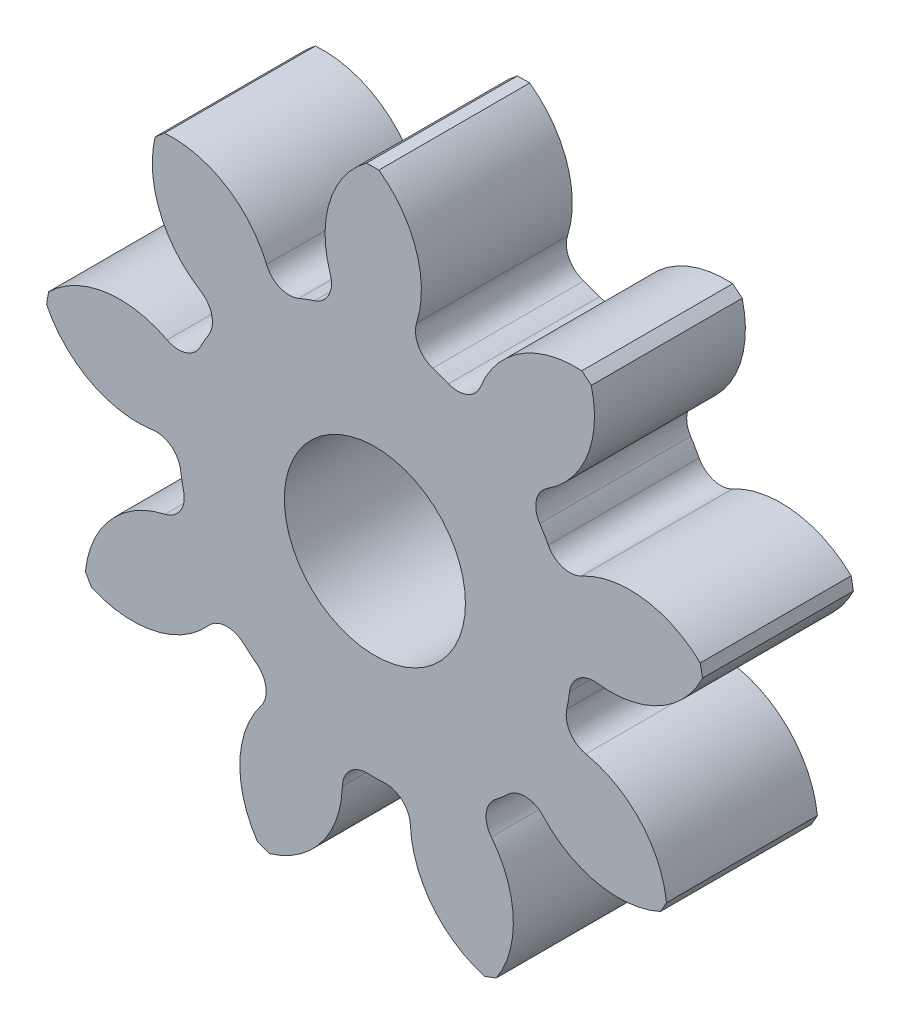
ISO-10303-21;
HEADER;
FILE_DESCRIPTION(('STEP AP214'),'2;1');
FILE_NAME('part.step','',(''),(''),'','','');
FILE_SCHEMA(('AUTOMOTIVE_DESIGN { 1 0 10303 214 1 1 1 1 }'));
ENDSEC;
DATA;
#1=APPLICATION_CONTEXT('core data for automotive mechanical design processes');
#2=APPLICATION_PROTOCOL_DEFINITION('international standard','automotive_design',2000,#1);
#3=PRODUCT_CONTEXT('',#1,'mechanical');
#4=PRODUCT('Part','Part','',(#3));
#5=PRODUCT_RELATED_PRODUCT_CATEGORY('part','',(#4));
#6=PRODUCT_DEFINITION_FORMATION('','',#4);
#7=PRODUCT_DEFINITION_CONTEXT('part definition',#1,'design');
#8=PRODUCT_DEFINITION('design','',#6,#7);
#9=PRODUCT_DEFINITION_SHAPE('','',#8);
#10=(LENGTH_UNIT() NAMED_UNIT(*) SI_UNIT(.MILLI.,.METRE.));
#11=(NAMED_UNIT(*) PLANE_ANGLE_UNIT() SI_UNIT($,.RADIAN.));
#12=(NAMED_UNIT(*) SI_UNIT($,.STERADIAN.) SOLID_ANGLE_UNIT());
#13=UNCERTAINTY_MEASURE_WITH_UNIT(LENGTH_MEASURE(1.E-05),#10,'distance_accuracy_value','');
#14=(GEOMETRIC_REPRESENTATION_CONTEXT(3) GLOBAL_UNCERTAINTY_ASSIGNED_CONTEXT((#13)) GLOBAL_UNIT_ASSIGNED_CONTEXT((#10,
#11,#12)) REPRESENTATION_CONTEXT('',''));
#15=CARTESIAN_POINT('',(0.,0.,0.));
#16=DIRECTION('',(0.,0.,1.));
#17=DIRECTION('',(1.,0.,0.));
#18=AXIS2_PLACEMENT_3D('',#15,#16,#17);
#19=CARTESIAN_POINT('',(0.,0.,127.));
#20=DIRECTION('',(0.,0.,-1.));
#21=DIRECTION('',(-1.,0.,0.));
#22=AXIS2_PLACEMENT_3D('',#19,#20,#21);
#23=CYLINDRICAL_SURFACE('',#22,279.4);
#24=DIRECTION('',(0.,0.,-1.));
#25=VECTOR('',#24,1.);
#26=CARTESIAN_POINT('',(102.152124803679,-260.056346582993,63.5));
#27=LINE('',#26,#25);
#28=CARTESIAN_POINT('',(102.152124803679,-260.056346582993,127.));
#29=VERTEX_POINT('',#28);
#30=CARTESIAN_POINT('',(102.152124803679,-260.056346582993,0.));
#31=VERTEX_POINT('',#30);
#32=EDGE_CURVE('E670',#29,#31,#27,.T.);
#33=ORIENTED_EDGE('',*,*,#32,.F.);
#34=CARTESIAN_POINT('',(0.,0.,127.));
#35=DIRECTION('',(0.,0.,1.));
#36=DIRECTION('',(1.,0.,0.));
#37=AXIS2_PLACEMENT_3D('',#34,#35,#36);
#38=CIRCLE('',#37,279.4);
#39=CARTESIAN_POINT('',(92.439392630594,-263.665163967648,127.));
#40=VERTEX_POINT('',#39);
#41=EDGE_CURVE('E748',#40,#29,#38,.T.);
#42=ORIENTED_EDGE('',*,*,#41,.F.);
#43=DIRECTION('',(0.,0.,-1.));
#44=VECTOR('',#43,1.);
#45=CARTESIAN_POINT('',(92.439392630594,-263.665163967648,63.5));
#46=LINE('',#45,#44);
#47=CARTESIAN_POINT('',(92.439392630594,-263.665163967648,0.));
#48=VERTEX_POINT('',#47);
#49=EDGE_CURVE('E666',#48,#40,#46,.F.);
#50=ORIENTED_EDGE('',*,*,#49,.F.);
#51=CARTESIAN_POINT('',(0.,0.,0.));
#52=DIRECTION('',(0.,0.,1.));
#53=DIRECTION('',(1.,0.,0.));
#54=AXIS2_PLACEMENT_3D('',#51,#52,#53);
#55=CIRCLE('',#54,279.4);
#56=EDGE_CURVE('E747',#48,#31,#55,.T.);
#57=ORIENTED_EDGE('',*,*,#56,.T.);
#58=EDGE_LOOP('',(#33,#42,#50,#57));
#59=FACE_BOUND('',#58,.T.);
#60=ADVANCED_FACE('F33',(#59),#23,.T.);
#61=DIRECTION('',(0.,0.,-1.));
#62=VECTOR('',#61,1.);
#63=CARTESIAN_POINT('',(240.293383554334,-142.560337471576,63.5));
#64=LINE('',#63,#62);
#65=CARTESIAN_POINT('',(240.293383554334,-142.560337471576,0.));
#66=VERTEX_POINT('',#65);
#67=CARTESIAN_POINT('',(240.293383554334,-142.560337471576,127.));
#68=VERTEX_POINT('',#67);
#69=EDGE_CURVE('E668',#66,#68,#64,.F.);
#70=ORIENTED_EDGE('',*,*,#69,.F.);
#71=CARTESIAN_POINT('',(245.414064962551,-133.552599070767,0.));
#72=VERTEX_POINT('',#71);
#73=EDGE_CURVE('E710',#66,#72,#55,.T.);
#74=ORIENTED_EDGE('',*,*,#73,.T.);
#75=DIRECTION('',(0.,0.,-1.));
#76=VECTOR('',#75,1.);
#77=CARTESIAN_POINT('',(245.414064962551,-133.552599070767,63.5));
#78=LINE('',#77,#76);
#79=CARTESIAN_POINT('',(245.414064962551,-133.552599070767,127.));
#80=VERTEX_POINT('',#79);
#81=EDGE_CURVE('E707',#80,#72,#78,.T.);
#82=ORIENTED_EDGE('',*,*,#81,.F.);
#83=EDGE_CURVE('E716',#68,#80,#38,.T.);
#84=ORIENTED_EDGE('',*,*,#83,.F.);
#85=EDGE_LOOP('',(#70,#74,#82,#84));
#86=FACE_BOUND('',#85,.T.);
#87=ADVANCED_FACE('F758',(#86),#23,.T.);
#88=DIRECTION('',(0.,0.,-1.));
#89=VECTOR('',#88,1.);
#90=CARTESIAN_POINT('',(-88.9079298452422,-264.876839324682,63.5));
#91=LINE('',#90,#89);
#92=CARTESIAN_POINT('',(-88.9079298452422,-264.876839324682,127.));
#93=VERTEX_POINT('',#92);
#94=CARTESIAN_POINT('',(-88.9079298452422,-264.876839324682,0.));
#95=VERTEX_POINT('',#94);
#96=EDGE_CURVE('E664',#93,#95,#91,.T.);
#97=ORIENTED_EDGE('',*,*,#96,.F.);
#98=CARTESIAN_POINT('',(-98.6680174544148,-261.398129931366,127.));
#99=VERTEX_POINT('',#98);
#100=EDGE_CURVE('E774',#99,#93,#38,.T.);
#101=ORIENTED_EDGE('',*,*,#100,.F.);
#102=DIRECTION('',(0.,0.,-1.));
#103=VECTOR('',#102,1.);
#104=CARTESIAN_POINT('',(-98.6680174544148,-261.398129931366,63.5));
#105=LINE('',#104,#103);
#106=CARTESIAN_POINT('',(-98.6680174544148,-261.398129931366,0.));
#107=VERTEX_POINT('',#106);
#108=EDGE_CURVE('E662',#107,#99,#105,.F.);
#109=ORIENTED_EDGE('',*,*,#108,.F.);
#110=EDGE_CURVE('E751',#107,#95,#55,.T.);
#111=ORIENTED_EDGE('',*,*,#110,.T.);
#112=EDGE_LOOP('',(#97,#101,#109,#111));
#113=FACE_BOUND('',#112,.T.);
#114=ADVANCED_FACE('F941',(#113),#23,.T.);
#115=DIRECTION('',(0.,0.,-1.));
#116=VECTOR('',#115,1.);
#117=CARTESIAN_POINT('',(-238.366976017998,-145.758515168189,63.5));
#118=LINE('',#117,#116);
#119=CARTESIAN_POINT('',(-238.366976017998,-145.758515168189,127.));
#120=VERTEX_POINT('',#119);
#121=CARTESIAN_POINT('',(-238.366976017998,-145.758515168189,0.));
#122=VERTEX_POINT('',#121);
#123=EDGE_CURVE('E660',#120,#122,#118,.T.);
#124=ORIENTED_EDGE('',*,*,#123,.F.);
#125=CARTESIAN_POINT('',(-243.607565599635,-136.820005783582,127.));
#126=VERTEX_POINT('',#125);
#127=EDGE_CURVE('E777',#126,#120,#38,.T.);
#128=ORIENTED_EDGE('',*,*,#127,.F.);
#129=DIRECTION('',(0.,0.,-1.));
#130=VECTOR('',#129,1.);
#131=CARTESIAN_POINT('',(-243.607565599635,-136.820005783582,63.5));
#132=LINE('',#131,#130);
#133=CARTESIAN_POINT('',(-243.607565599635,-136.820005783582,0.));
#134=VERTEX_POINT('',#133);
#135=EDGE_CURVE('E658',#134,#126,#132,.F.);
#136=ORIENTED_EDGE('',*,*,#135,.F.);
#137=EDGE_CURVE('E753',#134,#122,#55,.T.);
#138=ORIENTED_EDGE('',*,*,#137,.T.);
#139=EDGE_LOOP('',(#124,#128,#136,#138));
#140=FACE_BOUND('',#139,.T.);
#141=ADVANCED_FACE('F916',(#140),#23,.T.);
#142=DIRECTION('',(0.,0.,-1.));
#143=VECTOR('',#142,1.);
#144=CARTESIAN_POINT('',(-276.291464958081,41.5618381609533,63.5));
#145=LINE('',#144,#143);
#146=CARTESIAN_POINT('',(-276.291464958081,41.5618381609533,127.));
#147=VERTEX_POINT('',#146);
#148=CARTESIAN_POINT('',(-276.291464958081,41.5618381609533,0.));
#149=VERTEX_POINT('',#148);
#150=EDGE_CURVE('E656',#147,#149,#145,.T.);
#151=ORIENTED_EDGE('',*,*,#150,.F.);
#152=CARTESIAN_POINT('',(-274.56042640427,51.777719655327,127.));
#153=VERTEX_POINT('',#152);
#154=EDGE_CURVE('E782',#153,#147,#38,.T.);
#155=ORIENTED_EDGE('',*,*,#154,.F.);
#156=DIRECTION('',(0.,0.,-1.));
#157=VECTOR('',#156,1.);
#158=CARTESIAN_POINT('',(-274.56042640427,51.777719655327,63.5));
#159=LINE('',#158,#157);
#160=CARTESIAN_POINT('',(-274.56042640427,51.777719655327,0.));
#161=VERTEX_POINT('',#160);
#162=EDGE_CURVE('E654',#161,#153,#159,.F.);
#163=ORIENTED_EDGE('',*,*,#162,.F.);
#164=EDGE_CURVE('E884',#161,#149,#55,.T.);
#165=ORIENTED_EDGE('',*,*,#164,.T.);
#166=EDGE_LOOP('',(#151,#155,#163,#165));
#167=FACE_BOUND('',#166,.T.);
#168=ADVANCED_FACE('F890',(#167),#23,.T.);
#169=DIRECTION('',(0.,0.,-1.));
#170=VECTOR('',#169,1.);
#171=CARTESIAN_POINT('',(-184.936106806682,209.434945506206,63.5));
#172=LINE('',#171,#170);
#173=CARTESIAN_POINT('',(-184.936106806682,209.434945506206,127.));
#174=VERTEX_POINT('',#173);
#175=CARTESIAN_POINT('',(-184.936106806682,209.434945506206,0.));
#176=VERTEX_POINT('',#175);
#177=EDGE_CURVE('E652',#174,#176,#172,.T.);
#178=ORIENTED_EDGE('',*,*,#177,.F.);
#179=CARTESIAN_POINT('',(-177.0434122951,216.148074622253,127.));
#180=VERTEX_POINT('',#179);
#181=EDGE_CURVE('E787',#180,#174,#38,.T.);
#182=ORIENTED_EDGE('',*,*,#181,.F.);
#183=DIRECTION('',(0.,0.,-1.));
#184=VECTOR('',#183,1.);
#185=CARTESIAN_POINT('',(-177.0434122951,216.148074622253,63.5));
#186=LINE('',#185,#184);
#187=CARTESIAN_POINT('',(-177.0434122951,216.148074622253,0.));
#188=VERTEX_POINT('',#187);
#189=EDGE_CURVE('E650',#188,#180,#186,.F.);
#190=ORIENTED_EDGE('',*,*,#189,.F.);
#191=EDGE_CURVE('E857',#188,#176,#55,.T.);
#192=ORIENTED_EDGE('',*,*,#191,.T.);
#193=EDGE_LOOP('',(#178,#182,#190,#192));
#194=FACE_BOUND('',#193,.T.);
#195=ADVANCED_FACE('F863',(#194),#23,.T.);
#196=DIRECTION('',(0.,0.,-1.));
#197=VECTOR('',#196,1.);
#198=CARTESIAN_POINT('',(-7.04708894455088,279.311114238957,63.5));
#199=LINE('',#198,#197);
#200=CARTESIAN_POINT('',(-7.04708894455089,279.311114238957,127.));
#201=VERTEX_POINT('',#200);
#202=CARTESIAN_POINT('',(-7.04708894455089,279.311114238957,0.));
#203=VERTEX_POINT('',#202);
#204=EDGE_CURVE('E648',#201,#203,#199,.T.);
#205=ORIENTED_EDGE('',*,*,#204,.F.);
#206=CARTESIAN_POINT('',(3.31418204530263,279.380343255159,127.));
#207=VERTEX_POINT('',#206);
#208=EDGE_CURVE('E792',#207,#201,#38,.T.);
#209=ORIENTED_EDGE('',*,*,#208,.F.);
#210=DIRECTION('',(0.,0.,-1.));
#211=VECTOR('',#210,1.);
#212=CARTESIAN_POINT('',(3.31418204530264,279.380343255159,63.5));
#213=LINE('',#212,#211);
#214=CARTESIAN_POINT('',(3.31418204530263,279.380343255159,0.));
#215=VERTEX_POINT('',#214);
#216=EDGE_CURVE('E646',#215,#207,#213,.F.);
#217=ORIENTED_EDGE('',*,*,#216,.F.);
#218=EDGE_CURVE('E830',#215,#203,#55,.T.);
#219=ORIENTED_EDGE('',*,*,#218,.T.);
#220=EDGE_LOOP('',(#205,#209,#217,#219));
#221=FACE_BOUND('',#220,.T.);
#222=ADVANCED_FACE('F836',(#221),#23,.T.);
#223=DIRECTION('',(0.,0.,-1.));
#224=VECTOR('',#223,1.);
#225=CARTESIAN_POINT('',(174.139340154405,218.494508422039,63.5));
#226=LINE('',#225,#224);
#227=CARTESIAN_POINT('',(174.139340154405,218.494508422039,127.));
#228=VERTEX_POINT('',#227);
#229=CARTESIAN_POINT('',(174.139340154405,218.494508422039,0.));
#230=VERTEX_POINT('',#229);
#231=EDGE_CURVE('E644',#228,#230,#226,.T.);
#232=ORIENTED_EDGE('',*,*,#231,.F.);
#233=CARTESIAN_POINT('',(182.121033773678,211.887444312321,127.));
#234=VERTEX_POINT('',#233);
#235=EDGE_CURVE('E715',#234,#228,#38,.T.);
#236=ORIENTED_EDGE('',*,*,#235,.F.);
#237=DIRECTION('',(0.,0.,-1.));
#238=VECTOR('',#237,1.);
#239=CARTESIAN_POINT('',(182.121033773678,211.887444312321,63.5));
#240=LINE('',#239,#238);
#241=CARTESIAN_POINT('',(182.121033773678,211.887444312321,0.));
#242=VERTEX_POINT('',#241);
#243=EDGE_CURVE('E642',#242,#234,#240,.F.);
#244=ORIENTED_EDGE('',*,*,#243,.F.);
#245=EDGE_CURVE('E720',#242,#230,#55,.T.);
#246=ORIENTED_EDGE('',*,*,#245,.T.);
#247=EDGE_LOOP('',(#232,#236,#244,#246));
#248=FACE_BOUND('',#247,.T.);
#249=ADVANCED_FACE('F807',(#248),#23,.T.);
#250=DIRECTION('',(0.,0.,-1.));
#251=VECTOR('',#250,1.);
#252=CARTESIAN_POINT('',(273.844036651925,55.4418938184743,63.5));
#253=LINE('',#252,#251);
#254=CARTESIAN_POINT('',(273.844036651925,55.4418938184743,127.));
#255=VERTEX_POINT('',#254);
#256=CARTESIAN_POINT('',(273.844036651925,55.4418938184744,0.));
#257=VERTEX_POINT('',#256);
#258=EDGE_CURVE('E640',#255,#257,#253,.T.);
#259=ORIENTED_EDGE('',*,*,#258,.F.);
#260=CARTESIAN_POINT('',(275.711429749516,45.2500553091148,127.));
#261=VERTEX_POINT('',#260);
#262=EDGE_CURVE('E711',#261,#255,#38,.T.);
#263=ORIENTED_EDGE('',*,*,#262,.F.);
#264=DIRECTION('',(0.,0.,-1.));
#265=VECTOR('',#264,1.);
#266=CARTESIAN_POINT('',(275.711429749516,45.2500553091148,63.5));
#267=LINE('',#266,#265);
#268=CARTESIAN_POINT('',(275.711429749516,45.2500553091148,0.));
#269=VERTEX_POINT('',#268);
#270=EDGE_CURVE('E705',#269,#261,#267,.F.);
#271=ORIENTED_EDGE('',*,*,#270,.F.);
#272=EDGE_CURVE('E717',#269,#257,#55,.T.);
#273=ORIENTED_EDGE('',*,*,#272,.T.);
#274=EDGE_LOOP('',(#259,#263,#271,#273));
#275=FACE_BOUND('',#274,.T.);
#276=ADVANCED_FACE('F965',(#275),#23,.T.);
#277=CARTESIAN_POINT('',(0.,0.,127.));
#278=DIRECTION('',(0.,0.,1.));
#279=DIRECTION('',(1.,0.,0.));
#280=AXIS2_PLACEMENT_3D('',#277,#278,#279);
#281=PLANE('',#280);
#282=CARTESIAN_POINT('',(0.,0.,127.000000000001));
#283=DIRECTION('',(0.,0.,1.));
#284=DIRECTION('',(1.,0.,0.));
#285=AXIS2_PLACEMENT_3D('',#282,#283,#284);
#286=CIRCLE('',#285,76.2);
#287=CARTESIAN_POINT('',(76.2,0.,127.000000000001));
#288=VERTEX_POINT('',#287);
#289=EDGE_CURVE('E413',#288,#288,#286,.T.);
#290=ORIENTED_EDGE('',*,*,#289,.F.);
#291=EDGE_LOOP('',(#290));
#292=FACE_BOUND('',#291,.T.);
#293=ORIENTED_EDGE('',*,*,#41,.T.);
#294=CARTESIAN_POINT('',(30.8821943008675,-212.582289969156,127.));
#295=DIRECTION('',(0.,0.,-1.));
#296=DIRECTION('',(0.766044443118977,-0.642787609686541,0.));
#297=AXIS2_PLACEMENT_3D('',#294,#295,#296);
#298=CIRCLE('',#297,85.6340413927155);
#299=CARTESIAN_POINT('',(97.9867859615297,-159.383015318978,127.));
#300=VERTEX_POINT('',#299);
#301=EDGE_CURVE('E619',#300,#29,#298,.T.);
#302=ORIENTED_EDGE('',*,*,#301,.F.);
#303=CARTESIAN_POINT('',(114.188610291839,-146.538509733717,127.));
#304=DIRECTION('',(0.,0.,1.));
#305=DIRECTION('',(-0.766044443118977,0.642787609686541,0.));
#306=AXIS2_PLACEMENT_3D('',#303,#304,#305);
#307=CIRCLE('',#306,20.6756);
#308=CARTESIAN_POINT('',(101.480170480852,-130.229739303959,127.));
#309=VERTEX_POINT('',#308);
#310=EDGE_CURVE('E617',#309,#300,#307,.T.);
#311=ORIENTED_EDGE('',*,*,#310,.F.);
#312=CARTESIAN_POINT('',(0.,0.,127.));
#313=DIRECTION('',(0.,0.,-1.));
#314=DIRECTION('',(0.766044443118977,-0.642787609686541,0.));
#315=AXIS2_PLACEMENT_3D('',#312,#313,#314);
#316=CIRCLE('',#315,165.1);
#317=CARTESIAN_POINT('',(112.257134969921,-121.063395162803,127.));
#318=VERTEX_POINT('',#317);
#319=EDGE_CURVE('E614',#318,#309,#316,.T.);
#320=ORIENTED_EDGE('',*,*,#319,.F.);
#321=CARTESIAN_POINT('',(126.315182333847,-136.224257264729,127.));
#322=DIRECTION('',(0.,0.,1.));
#323=DIRECTION('',(-0.766044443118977,0.642787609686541,0.));
#324=AXIS2_PLACEMENT_3D('',#321,#322,#323);
#325=CIRCLE('',#324,20.6756);
#326=CARTESIAN_POINT('',(141.593184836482,-122.293604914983,127.));
#327=VERTEX_POINT('',#326);
#328=EDGE_CURVE('E612',#327,#318,#325,.T.);
#329=ORIENTED_EDGE('',*,*,#328,.F.);
#330=CARTESIAN_POINT('',(204.871498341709,-64.5957359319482,127.));
#331=DIRECTION('',(0.,0.,-1.));
#332=DIRECTION('',(-0.766044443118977,0.642787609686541,0.));
#333=AXIS2_PLACEMENT_3D('',#330,#331,#332);
#334=CIRCLE('',#333,85.6340413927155);
#335=EDGE_CURVE('E621',#68,#327,#334,.T.);
#336=ORIENTED_EDGE('',*,*,#335,.F.);
#337=ORIENTED_EDGE('',*,*,#83,.T.);
#338=CARTESIAN_POINT('',(160.302395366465,-142.996790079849,127.));
#339=DIRECTION('',(0.,0.,-1.));
#340=DIRECTION('',(1.,0.,0.));
#341=AXIS2_PLACEMENT_3D('',#338,#339,#340);
#342=CIRCLE('',#341,85.6340413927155);
#343=CARTESIAN_POINT('',(177.511660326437,-59.1097812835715,127.));
#344=VERTEX_POINT('',#343);
#345=EDGE_CURVE('E680',#344,#80,#342,.T.);
#346=ORIENTED_EDGE('',*,*,#345,.F.);
#347=CARTESIAN_POINT('',(181.666688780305,-38.8559872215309,127.));
#348=DIRECTION('',(0.,0.,1.));
#349=DIRECTION('',(-1.,0.,0.));
#350=AXIS2_PLACEMENT_3D('',#347,#348,#349);
#351=CIRCLE('',#350,20.6756);
#352=CARTESIAN_POINT('',(161.448383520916,-34.5315719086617,127.));
#353=VERTEX_POINT('',#352);
#354=EDGE_CURVE('E678',#353,#344,#351,.T.);
#355=ORIENTED_EDGE('',*,*,#354,.F.);
#356=CARTESIAN_POINT('',(0.,0.,127.));
#357=DIRECTION('',(0.,0.,-1.));
#358=DIRECTION('',(1.,0.,0.));
#359=AXIS2_PLACEMENT_3D('',#356,#357,#358);
#360=CIRCLE('',#359,165.1);
#361=CARTESIAN_POINT('',(163.8120048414,-20.5824456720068,127.));
#362=VERTEX_POINT('',#361);
#363=EDGE_CURVE('E675',#362,#353,#360,.T.);
#364=ORIENTED_EDGE('',*,*,#363,.F.);
#365=CARTESIAN_POINT('',(184.326308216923,-23.1600011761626,127.));
#366=DIRECTION('',(0.,0.,1.));
#367=DIRECTION('',(-1.,0.,0.));
#368=AXIS2_PLACEMENT_3D('',#365,#366,#367);
#369=CIRCLE('',#368,20.6756);
#370=CARTESIAN_POINT('',(187.075486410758,-2.66799164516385,127.));
#371=VERTEX_POINT('',#370);
#372=EDGE_CURVE('E673',#371,#362,#369,.T.);
#373=ORIENTED_EDGE('',*,*,#372,.F.);
#374=CARTESIAN_POINT('',(198.462011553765,82.2056561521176,127.));
#375=DIRECTION('',(0.,0.,-1.));
#376=DIRECTION('',(-1.,0.,0.));
#377=AXIS2_PLACEMENT_3D('',#374,#375,#376);
#378=CIRCLE('',#377,85.6340413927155);
#379=EDGE_CURVE('E683',#261,#371,#378,.T.);
#380=ORIENTED_EDGE('',*,*,#379,.F.);
#381=ORIENTED_EDGE('',*,*,#262,.T.);
#382=CARTESIAN_POINT('',(214.715324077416,-6.50150287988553,127.));
#383=DIRECTION('',(0.,0.,-1.));
#384=DIRECTION('',(0.766044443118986,0.64278760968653,0.));
#385=AXIS2_PLACEMENT_3D('',#382,#383,#384);
#386=CIRCLE('',#385,85.6340413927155);
#387=CARTESIAN_POINT('',(173.976856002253,68.8215763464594,127.));
#388=VERTEX_POINT('',#387);
#389=EDGE_CURVE('E404',#388,#255,#386,.T.);
#390=ORIENTED_EDGE('',*,*,#389,.F.);
#391=CARTESIAN_POINT('',(164.140904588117,87.007683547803,127.));
#392=DIRECTION('',(0.,0.,1.));
#393=DIRECTION('',(-0.766044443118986,-0.64278760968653,0.));
#394=AXIS2_PLACEMENT_3D('',#391,#392,#393);
#395=CIRCLE('',#394,20.6756);
#396=CARTESIAN_POINT('',(145.873103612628,77.3243017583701,127.));
#397=VERTEX_POINT('',#396);
#398=EDGE_CURVE('E402',#397,#388,#395,.T.);
#399=ORIENTED_EDGE('',*,*,#398,.F.);
#400=CARTESIAN_POINT('',(0.,0.,127.));
#401=DIRECTION('',(0.,0.,-1.));
#402=DIRECTION('',(0.766044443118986,0.64278760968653,0.));
#403=AXIS2_PLACEMENT_3D('',#400,#401,#402);
#404=CIRCLE('',#403,165.1);
#405=CARTESIAN_POINT('',(138.717417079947,89.5292588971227,127.));
#406=VERTEX_POINT('',#405);
#407=EDGE_CURVE('E387',#406,#397,#404,.T.);
#408=ORIENTED_EDGE('',*,*,#407,.F.);
#409=CARTESIAN_POINT('',(156.089105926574,100.74107685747,127.));
#410=DIRECTION('',(0.,0.,1.));
#411=DIRECTION('',(-0.766044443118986,-0.64278760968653,0.));
#412=AXIS2_PLACEMENT_3D('',#409,#410,#411);
#413=CIRCLE('',#412,20.6756);
#414=CARTESIAN_POINT('',(145.023088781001,118.20600456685,127.));
#415=VERTEX_POINT('',#414);
#416=EDGE_CURVE('E377',#415,#406,#413,.T.);
#417=ORIENTED_EDGE('',*,*,#416,.F.);
#418=CARTESIAN_POINT('',(99.1899439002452,190.542108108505,127.));
#419=DIRECTION('',(0.,0.,-1.));
#420=DIRECTION('',(-0.766044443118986,-0.64278760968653,0.));
#421=AXIS2_PLACEMENT_3D('',#418,#419,#420);
#422=CIRCLE('',#421,85.6340413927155);
#423=EDGE_CURVE('E409',#234,#415,#422,.T.);
#424=ORIENTED_EDGE('',*,*,#423,.F.);
#425=ORIENTED_EDGE('',*,*,#235,.T.);
#426=CARTESIAN_POINT('',(168.660566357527,133.035909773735,127.));
#427=DIRECTION('',(0.,0.,-1.));
#428=DIRECTION('',(0.17364817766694,0.984807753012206,0.));
#429=AXIS2_PLACEMENT_3D('',#426,#427,#428);
#430=CIRCLE('',#429,85.6340413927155);
#431=CARTESIAN_POINT('',(89.0363472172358,164.550553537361,127.));
#432=VERTEX_POINT('',#431);
#433=EDGE_CURVE('E431',#432,#228,#430,.T.);
#434=ORIENTED_EDGE('',*,*,#433,.F.);
#435=CARTESIAN_POINT('',(69.8117669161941,172.159492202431,127.));
#436=DIRECTION('',(0.,0.,1.));
#437=DIRECTION('',(-0.17364817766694,-0.984807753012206,0.));
#438=AXIS2_PLACEMENT_3D('',#435,#436,#437);
#439=CIRCLE('',#438,20.6756);
#440=CARTESIAN_POINT('',(62.042177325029,152.999275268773,127.));
#441=VERTEX_POINT('',#440);
#442=EDGE_CURVE('E429',#441,#432,#439,.T.);
#443=ORIENTED_EDGE('',*,*,#442,.F.);
#444=CARTESIAN_POINT('',(0.,0.,127.));
#445=DIRECTION('',(0.,0.,-1.));
#446=DIRECTION('',(0.17364817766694,0.984807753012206,0.));
#447=AXIS2_PLACEMENT_3D('',#444,#445,#446);
#448=CIRCLE('',#447,165.1);
#449=CARTESIAN_POINT('',(48.715408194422,157.749228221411,127.));
#450=VERTEX_POINT('',#449);
#451=EDGE_CURVE('E426',#450,#441,#448,.T.);
#452=ORIENTED_EDGE('',*,*,#451,.F.);
#453=CARTESIAN_POINT('',(54.8160762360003,177.504285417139,127.));
#454=DIRECTION('',(0.,0.,1.));
#455=DIRECTION('',(-0.17364817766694,-0.984807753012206,0.));
#456=AXIS2_PLACEMENT_3D('',#453,#454,#455);
#457=CIRCLE('',#456,20.6756);
#458=CARTESIAN_POINT('',(35.1127761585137,183.77009752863,127.));
#459=VERTEX_POINT('',#458);
#460=EDGE_CURVE('E424',#459,#450,#457,.T.);
#461=ORIENTED_EDGE('',*,*,#460,.F.);
#462=CARTESIAN_POINT('',(-46.4942008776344,209.721790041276,127.));
#463=DIRECTION('',(0.,0.,-1.));
#464=DIRECTION('',(-0.17364817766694,-0.984807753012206,0.));
#465=AXIS2_PLACEMENT_3D('',#462,#463,#464);
#466=CIRCLE('',#465,85.6340413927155);
#467=EDGE_CURVE('E433',#207,#459,#466,.T.);
#468=ORIENTED_EDGE('',*,*,#467,.F.);
#469=ORIENTED_EDGE('',*,*,#208,.T.);
#470=CARTESIAN_POINT('',(43.6876551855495,210.32434171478,127.));
#471=DIRECTION('',(0.,0.,-1.));
#472=DIRECTION('',(-0.499999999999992,0.866025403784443,0.));
#473=AXIS2_PLACEMENT_3D('',#470,#471,#472);
#474=CIRCLE('',#473,85.6340413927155);
#475=CARTESIAN_POINT('',(-37.5652579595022,183.284497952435,127.));
#476=VERTEX_POINT('',#475);
#477=EDGE_CURVE('E463',#476,#201,#474,.T.);
#478=ORIENTED_EDGE('',*,*,#477,.F.);
#479=CARTESIAN_POINT('',(-57.1830723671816,176.755961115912,127.));
#480=DIRECTION('',(0.,0.,1.));
#481=DIRECTION('',(0.499999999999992,-0.866025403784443,0.));
#482=AXIS2_PLACEMENT_3D('',#479,#480,#481);
#483=CIRCLE('',#482,20.6756);
#484=CARTESIAN_POINT('',(-50.8189732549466,157.084187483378,127.));
#485=VERTEX_POINT('',#484);
#486=EDGE_CURVE('E461',#485,#476,#483,.T.);
#487=ORIENTED_EDGE('',*,*,#486,.F.);
#488=CARTESIAN_POINT('',(0.,0.,127.));
#489=DIRECTION('',(0.,0.,-1.));
#490=DIRECTION('',(-0.499999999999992,0.866025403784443,0.));
#491=AXIS2_PLACEMENT_3D('',#488,#489,#490);
#492=CIRCLE('',#491,165.1);
#493=CARTESIAN_POINT('',(-64.0810815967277,152.156580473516,127.));
#494=VERTEX_POINT('',#493);
#495=EDGE_CURVE('E458',#494,#485,#492,.T.);
#496=ORIENTED_EDGE('',*,*,#495,.F.);
#497=CARTESIAN_POINT('',(-72.1060047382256,171.211266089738,127.));
#498=DIRECTION('',(0.,0.,1.));
#499=DIRECTION('',(0.499999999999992,-0.866025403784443,0.));
#500=AXIS2_PLACEMENT_3D('',#497,#498,#499);
#501=CIRCLE('',#500,20.6756);
#502=CARTESIAN_POINT('',(-91.2271946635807,163.346119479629,127.));
#503=VERTEX_POINT('',#502);
#504=EDGE_CURVE('E456',#503,#494,#501,.T.);
#505=ORIENTED_EDGE('',*,*,#504,.F.);
#506=CARTESIAN_POINT('',(-170.423192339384,130.770315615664,127.));
#507=DIRECTION('',(0.,0.,-1.));
#508=DIRECTION('',(0.499999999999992,-0.866025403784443,0.));
#509=AXIS2_PLACEMENT_3D('',#506,#507,#508);
#510=CIRCLE('',#509,85.6340413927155);
#511=EDGE_CURVE('E465',#180,#503,#510,.T.);
#512=ORIENTED_EDGE('',*,*,#511,.F.);
#513=ORIENTED_EDGE('',*,*,#181,.T.);
#514=CARTESIAN_POINT('',(-101.72719538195,189.199676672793,127.));
#515=DIRECTION('',(0.,0.,-1.));
#516=DIRECTION('',(-0.939692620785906,0.342020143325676,0.));
#517=AXIS2_PLACEMENT_3D('',#514,#515,#516);
#518=CIRCLE('',#517,85.6340413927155);
#519=CARTESIAN_POINT('',(-146.589661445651,116.257588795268,127.));
#520=VERTEX_POINT('',#519);
#521=EDGE_CURVE('E495',#520,#174,#518,.T.);
#522=ORIENTED_EDGE('',*,*,#521,.F.);
#523=CARTESIAN_POINT('',(-157.421316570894,98.646351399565,127.));
#524=DIRECTION('',(0.,0.,1.));
#525=DIRECTION('',(0.939692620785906,-0.342020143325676,0.));
#526=AXIS2_PLACEMENT_3D('',#523,#524,#525);
#527=CIRCLE('',#526,20.6756);
#528=CARTESIAN_POINT('',(-139.901361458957,87.6676625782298,127.));
#529=VERTEX_POINT('',#528);
#530=EDGE_CURVE('E493',#529,#520,#527,.T.);
#531=ORIENTED_EDGE('',*,*,#530,.F.);
#532=CARTESIAN_POINT('',(0.,0.,127.));
#533=DIRECTION('',(0.,0.,-1.));
#534=DIRECTION('',(-0.939692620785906,0.342020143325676,0.));
#535=AXIS2_PLACEMENT_3D('',#532,#533,#534);
#536=CIRCLE('',#535,165.1);
#537=CARTESIAN_POINT('',(-146.893321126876,75.3681776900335,127.));
#538=VERTEX_POINT('',#537);
#539=EDGE_CURVE('E490',#538,#529,#536,.T.);
#540=ORIENTED_EDGE('',*,*,#539,.F.);
#541=CARTESIAN_POINT('',(-165.288884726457,84.8065925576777,127.));
#542=DIRECTION('',(0.,0.,1.));
#543=DIRECTION('',(0.939692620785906,-0.342020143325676,0.));
#544=AXIS2_PLACEMENT_3D('',#541,#542,#543);
#545=CIRCLE('',#544,20.6756);
#546=CARTESIAN_POINT('',(-174.880947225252,66.4906767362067,127.));
#547=VERTEX_POINT('',#546);
#548=EDGE_CURVE('E488',#547,#538,#545,.T.);
#549=ORIENTED_EDGE('',*,*,#548,.F.);
#550=CARTESIAN_POINT('',(-214.609278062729,-9.37004283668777,127.));
#551=DIRECTION('',(0.,0.,-1.));
#552=DIRECTION('',(0.939692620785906,-0.342020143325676,0.));
#553=AXIS2_PLACEMENT_3D('',#550,#551,#552);
#554=CIRCLE('',#553,85.6340413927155);
#555=EDGE_CURVE('E497',#153,#547,#554,.T.);
#556=ORIENTED_EDGE('',*,*,#555,.F.);
#557=ORIENTED_EDGE('',*,*,#154,.T.);
#558=CARTESIAN_POINT('',(-199.542760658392,79.5463801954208,127.));
#559=DIRECTION('',(0.,0.,-1.));
#560=DIRECTION('',(-0.939692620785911,-0.342020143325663,0.));
#561=AXIS2_PLACEMENT_3D('',#558,#559,#560);
#562=CIRCLE('',#561,85.6340413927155);
#563=CARTESIAN_POINT('',(-187.023133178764,-5.16753821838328,127.));
#564=VERTEX_POINT('',#563);
#565=EDGE_CURVE('E527',#564,#147,#562,.T.);
#566=ORIENTED_EDGE('',*,*,#565,.F.);
#567=CARTESIAN_POINT('',(-184.000377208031,-25.6209824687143,127.));
#568=DIRECTION('',(0.,0.,1.));
#569=DIRECTION('',(0.939692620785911,0.342020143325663,0.));
#570=AXIS2_PLACEMENT_3D('',#567,#568,#569);
#571=CIRCLE('',#570,20.6756);
#572=CARTESIAN_POINT('',(-163.52234780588,-22.769535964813,127.));
#573=VERTEX_POINT('',#572);
#574=EDGE_CURVE('E525',#573,#564,#571,.T.);
#575=ORIENTED_EDGE('',*,*,#574,.F.);
#576=CARTESIAN_POINT('',(0.,0.,127.));
#577=DIRECTION('',(0.,0.,-1.));
#578=DIRECTION('',(-0.939692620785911,-0.342020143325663,0.));
#579=AXIS2_PLACEMENT_3D('',#576,#577,#578);
#580=CIRCLE('',#579,165.1);
#581=CARTESIAN_POINT('',(-160.972543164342,-36.6858330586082,127.));
#582=VERTEX_POINT('',#581);
#583=EDGE_CURVE('E522',#582,#573,#580,.T.);
#584=ORIENTED_EDGE('',*,*,#583,.F.);
#585=CARTESIAN_POINT('',(-181.131258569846,-41.2800281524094,127.));
#586=DIRECTION('',(0.,0.,1.));
#587=DIRECTION('',(0.939692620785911,0.342020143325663,0.));
#588=AXIS2_PLACEMENT_3D('',#585,#586,#587);
#589=CIRCLE('',#588,20.6756);
#590=CARTESIAN_POINT('',(-176.705960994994,-61.4764926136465,127.));
#591=VERTEX_POINT('',#590);
#592=EDGE_CURVE('E520',#591,#582,#589,.T.);
#593=ORIENTED_EDGE('',*,*,#592,.F.);
#594=CARTESIAN_POINT('',(-158.377297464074,-145.126054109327,127.));
#595=DIRECTION('',(0.,0.,-1.));
#596=DIRECTION('',(0.939692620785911,0.342020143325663,0.));
#597=AXIS2_PLACEMENT_3D('',#594,#595,#596);
#598=CIRCLE('',#597,85.6340413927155);
#599=EDGE_CURVE('E529',#126,#591,#598,.T.);
#600=ORIENTED_EDGE('',*,*,#599,.F.);
#601=ORIENTED_EDGE('',*,*,#127,.T.);
#602=CARTESIAN_POINT('',(-203.990050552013,-67.32755163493,127.));
#603=DIRECTION('',(0.,0.,-1.));
#604=DIRECTION('',(-0.500000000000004,-0.866025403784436,0.));
#605=AXIS2_PLACEMENT_3D('',#602,#603,#604);
#606=CIRCLE('',#605,85.6340413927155);
#607=CARTESIAN_POINT('',(-139.946402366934,-124.174716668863,127.));
#608=VERTEX_POINT('',#607);
#609=EDGE_CURVE('E559',#608,#120,#606,.T.);
#610=ORIENTED_EDGE('',*,*,#609,.F.);
#611=CARTESIAN_POINT('',(-124.483616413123,-137.89997389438,127.));
#612=DIRECTION('',(0.,0.,1.));
#613=DIRECTION('',(0.500000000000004,0.866025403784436,0.));
#614=AXIS2_PLACEMENT_3D('',#611,#612,#613);
#615=CIRCLE('',#614,20.6756);
#616=CARTESIAN_POINT('',(-110.629410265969,-122.552615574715,127.));
#617=VERTEX_POINT('',#616);
#618=EDGE_CURVE('E557',#617,#608,#615,.T.);
#619=ORIENTED_EDGE('',*,*,#618,.F.);
#620=CARTESIAN_POINT('',(0.,0.,127.));
#621=DIRECTION('',(0.,0.,-1.));
#622=DIRECTION('',(-0.500000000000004,-0.866025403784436,0.));
#623=AXIS2_PLACEMENT_3D('',#620,#621,#622);
#624=CIRCLE('',#623,165.1);
#625=CARTESIAN_POINT('',(-99.7309232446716,-131.574134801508,127.));
#626=VERTEX_POINT('',#625);
#627=EDGE_CURVE('E554',#626,#617,#624,.T.);
#628=ORIENTED_EDGE('',*,*,#627,.F.);
#629=CARTESIAN_POINT('',(-112.220303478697,-148.051264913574,127.));
#630=DIRECTION('',(0.,0.,1.));
#631=DIRECTION('',(0.500000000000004,0.866025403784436,0.));
#632=AXIS2_PLACEMENT_3D('',#629,#630,#631);
#633=CIRCLE('',#632,20.6756);
#634=CARTESIAN_POINT('',(-95.848291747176,-160.678127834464,127.));
#635=VERTEX_POINT('',#634);
#636=EDGE_CURVE('E552',#635,#626,#633,.T.);
#637=ORIENTED_EDGE('',*,*,#636,.F.);
#638=CARTESIAN_POINT('',(-28.0388192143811,-212.97597176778,127.));
#639=DIRECTION('',(0.,0.,-1.));
#640=DIRECTION('',(0.500000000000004,0.866025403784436,0.));
#641=AXIS2_PLACEMENT_3D('',#638,#639,#640);
#642=CIRCLE('',#641,85.6340413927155);
#643=EDGE_CURVE('E561',#99,#635,#642,.T.);
#644=ORIENTED_EDGE('',*,*,#643,.F.);
#645=ORIENTED_EDGE('',*,*,#100,.T.);
#646=CARTESIAN_POINT('',(-112.988128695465,-182.698173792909,127.));
#647=DIRECTION('',(0.,0.,-1.));
#648=DIRECTION('',(0.173648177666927,-0.984807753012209,0.));
#649=AXIS2_PLACEMENT_3D('',#646,#647,#648);
#650=CIRCLE('',#649,85.6340413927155);
#651=CARTESIAN_POINT('',(-27.3871945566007,-185.079165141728,127.));
#652=VERTEX_POINT('',#651);
#653=EDGE_CURVE('E590',#652,#93,#650,.T.);
#654=ORIENTED_EDGE('',*,*,#653,.F.);
#655=CARTESIAN_POINT('',(-6.71958801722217,-185.654034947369,127.));
#656=DIRECTION('',(0.,0.,1.));
#657=DIRECTION('',(-0.173648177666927,0.984807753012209,0.));
#658=AXIS2_PLACEMENT_3D('',#655,#656,#657);
#659=CIRCLE('',#658,20.6756);
#660=CARTESIAN_POINT('',(-5.97174215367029,-164.991964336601,127.));
#661=VERTEX_POINT('',#660);
#662=EDGE_CURVE('E588',#661,#652,#659,.T.);
#663=ORIENTED_EDGE('',*,*,#662,.F.);
#664=CARTESIAN_POINT('',(0.,0.,127.));
#665=DIRECTION('',(0.,0.,-1.));
#666=DIRECTION('',(0.173648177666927,-0.984807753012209,0.));
#667=AXIS2_PLACEMENT_3D('',#664,#665,#666);
#668=CIRCLE('',#667,165.1);
#669=CARTESIAN_POINT('',(8.17590404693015,-164.897436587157,127.));
#670=VERTEX_POINT('',#669);
#671=EDGE_CURVE('E586',#670,#661,#668,.T.);
#672=ORIENTED_EDGE('',*,*,#671,.F.);
#673=CARTESIAN_POINT('',(9.19977879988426,-185.547669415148,127.));
#674=DIRECTION('',(0.,0.,1.));
#675=DIRECTION('',(-0.173648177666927,0.984807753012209,0.));
#676=AXIS2_PLACEMENT_3D('',#673,#674,#675);
#677=CIRCLE('',#676,20.6756);
#678=CARTESIAN_POINT('',(29.8578584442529,-184.696681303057,127.));
#679=VERTEX_POINT('',#678);
#680=EDGE_CURVE('E584',#679,#670,#677,.T.);
#681=ORIENTED_EDGE('',*,*,#680,.F.);
#682=CARTESIAN_POINT('',(115.419334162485,-181.172065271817,127.));
#683=DIRECTION('',(0.,0.,-1.));
#684=DIRECTION('',(-0.173648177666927,0.984807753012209,0.));
#685=AXIS2_PLACEMENT_3D('',#682,#683,#684);
#686=CIRCLE('',#685,85.6340413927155);
#687=EDGE_CURVE('E592',#40,#679,#686,.T.);
#688=ORIENTED_EDGE('',*,*,#687,.F.);
#689=EDGE_LOOP('',(#293,#302,#311,#320,#329,#336,#337,#346,#355,#364,#373,#380,#381,#390,#399,
#408,#417,#424,#425,#434,#443,#452,#461,#468,#469,#478,#487,#496,#505,#512,#513,#522,#531,#540,
#549,#556,#557,#566,#575,#584,#593,#600,#601,#610,#619,#628,#637,#644,#645,#654,#663,#672,#681,#688));
#690=FACE_BOUND('',#689,.T.);
#691=ADVANCED_FACE('F400',(#292,#690),#281,.T.);
#692=CARTESIAN_POINT('',(0.,0.,0.));
#693=DIRECTION('',(0.,0.,1.));
#694=DIRECTION('',(1.,0.,0.));
#695=AXIS2_PLACEMENT_3D('',#692,#693,#694);
#696=PLANE('',#695);
#697=CARTESIAN_POINT('',(0.,0.,0.));
#698=DIRECTION('',(0.,0.,1.));
#699=DIRECTION('',(1.,0.,0.));
#700=AXIS2_PLACEMENT_3D('',#697,#698,#699);
#701=CIRCLE('',#700,76.2);
#702=CARTESIAN_POINT('',(76.2,0.,-1.77635683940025E-12));
#703=VERTEX_POINT('',#702);
#704=EDGE_CURVE('E36',#703,#703,#701,.T.);
#705=ORIENTED_EDGE('',*,*,#704,.T.);
#706=EDGE_LOOP('',(#705));
#707=FACE_BOUND('',#706,.T.);
#708=CARTESIAN_POINT('',(30.8821943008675,-212.582289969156,0.));
#709=DIRECTION('',(0.,0.,-1.));
#710=DIRECTION('',(0.766044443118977,-0.642787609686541,0.));
#711=AXIS2_PLACEMENT_3D('',#708,#709,#710);
#712=CIRCLE('',#711,85.6340413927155);
#713=CARTESIAN_POINT('',(97.9867859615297,-159.383015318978,0.));
#714=VERTEX_POINT('',#713);
#715=EDGE_CURVE('E615',#714,#31,#712,.T.);
#716=ORIENTED_EDGE('',*,*,#715,.T.);
#717=ORIENTED_EDGE('',*,*,#56,.F.);
#718=CARTESIAN_POINT('',(115.419334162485,-181.172065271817,0.));
#719=DIRECTION('',(0.,0.,1.));
#720=DIRECTION('',(1.,0.,0.));
#721=AXIS2_PLACEMENT_3D('',#718,#719,#720);
#722=CIRCLE('',#721,85.6340413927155);
#723=CARTESIAN_POINT('',(29.8578584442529,-184.696681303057,0.));
#724=VERTEX_POINT('',#723);
#725=EDGE_CURVE('E41',#724,#48,#722,.T.);
#726=ORIENTED_EDGE('',*,*,#725,.F.);
#727=CARTESIAN_POINT('',(9.19977879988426,-185.547669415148,0.));
#728=DIRECTION('',(0.,0.,1.));
#729=DIRECTION('',(-0.173648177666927,0.984807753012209,0.));
#730=AXIS2_PLACEMENT_3D('',#727,#728,#729);
#731=CIRCLE('',#730,20.6756);
#732=CARTESIAN_POINT('',(8.17590404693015,-164.897436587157,0.));
#733=VERTEX_POINT('',#732);
#734=EDGE_CURVE('E583',#724,#733,#731,.T.);
#735=ORIENTED_EDGE('',*,*,#734,.T.);
#736=CARTESIAN_POINT('',(0.,0.,0.));
#737=DIRECTION('',(0.,0.,-1.));
#738=DIRECTION('',(0.173648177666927,-0.984807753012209,0.));
#739=AXIS2_PLACEMENT_3D('',#736,#737,#738);
#740=CIRCLE('',#739,165.1);
#741=CARTESIAN_POINT('',(-5.97174215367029,-164.991964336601,0.));
#742=VERTEX_POINT('',#741);
#743=EDGE_CURVE('E597',#733,#742,#740,.T.);
#744=ORIENTED_EDGE('',*,*,#743,.T.);
#745=CARTESIAN_POINT('',(-6.71958801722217,-185.654034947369,0.));
#746=DIRECTION('',(0.,0.,1.));
#747=DIRECTION('',(-0.173648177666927,0.984807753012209,0.));
#748=AXIS2_PLACEMENT_3D('',#745,#746,#747);
#749=CIRCLE('',#748,20.6756);
#750=CARTESIAN_POINT('',(-27.3871945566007,-185.079165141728,0.));
#751=VERTEX_POINT('',#750);
#752=EDGE_CURVE('E600',#742,#751,#749,.T.);
#753=ORIENTED_EDGE('',*,*,#752,.T.);
#754=CARTESIAN_POINT('',(-112.988128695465,-182.698173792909,0.));
#755=DIRECTION('',(0.,0.,-1.));
#756=DIRECTION('',(0.173648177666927,-0.984807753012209,0.));
#757=AXIS2_PLACEMENT_3D('',#754,#755,#756);
#758=CIRCLE('',#757,85.6340413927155);
#759=EDGE_CURVE('E56',#751,#95,#758,.T.);
#760=ORIENTED_EDGE('',*,*,#759,.T.);
#761=ORIENTED_EDGE('',*,*,#110,.F.);
#762=CARTESIAN_POINT('',(-28.0388192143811,-212.97597176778,0.));
#763=DIRECTION('',(0.,0.,1.));
#764=DIRECTION('',(1.,0.,0.));
#765=AXIS2_PLACEMENT_3D('',#762,#763,#764);
#766=CIRCLE('',#765,85.6340413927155);
#767=CARTESIAN_POINT('',(-95.848291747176,-160.678127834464,0.));
#768=VERTEX_POINT('',#767);
#769=EDGE_CURVE('E732',#768,#107,#766,.T.);
#770=ORIENTED_EDGE('',*,*,#769,.F.);
#771=CARTESIAN_POINT('',(-112.220303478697,-148.051264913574,0.));
#772=DIRECTION('',(0.,0.,1.));
#773=DIRECTION('',(0.500000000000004,0.866025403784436,0.));
#774=AXIS2_PLACEMENT_3D('',#771,#772,#773);
#775=CIRCLE('',#774,20.6756);
#776=CARTESIAN_POINT('',(-99.7309232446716,-131.574134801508,0.));
#777=VERTEX_POINT('',#776);
#778=EDGE_CURVE('E551',#768,#777,#775,.T.);
#779=ORIENTED_EDGE('',*,*,#778,.T.);
#780=CARTESIAN_POINT('',(0.,0.,0.));
#781=DIRECTION('',(0.,0.,-1.));
#782=DIRECTION('',(-0.500000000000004,-0.866025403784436,0.));
#783=AXIS2_PLACEMENT_3D('',#780,#781,#782);
#784=CIRCLE('',#783,165.1);
#785=CARTESIAN_POINT('',(-110.629410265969,-122.552615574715,0.));
#786=VERTEX_POINT('',#785);
#787=EDGE_CURVE('E566',#777,#786,#784,.T.);
#788=ORIENTED_EDGE('',*,*,#787,.T.);
#789=CARTESIAN_POINT('',(-124.483616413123,-137.89997389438,0.));
#790=DIRECTION('',(0.,0.,1.));
#791=DIRECTION('',(0.500000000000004,0.866025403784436,0.));
#792=AXIS2_PLACEMENT_3D('',#789,#790,#791);
#793=CIRCLE('',#792,20.6756);
#794=CARTESIAN_POINT('',(-139.946402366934,-124.174716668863,0.));
#795=VERTEX_POINT('',#794);
#796=EDGE_CURVE('E569',#786,#795,#793,.T.);
#797=ORIENTED_EDGE('',*,*,#796,.T.);
#798=CARTESIAN_POINT('',(-203.990050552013,-67.32755163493,0.));
#799=DIRECTION('',(0.,0.,-1.));
#800=DIRECTION('',(-0.500000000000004,-0.866025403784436,0.));
#801=AXIS2_PLACEMENT_3D('',#798,#799,#800);
#802=CIRCLE('',#801,85.6340413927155);
#803=EDGE_CURVE('E555',#795,#122,#802,.T.);
#804=ORIENTED_EDGE('',*,*,#803,.T.);
#805=ORIENTED_EDGE('',*,*,#137,.F.);
#806=CARTESIAN_POINT('',(-158.377297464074,-145.126054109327,0.));
#807=DIRECTION('',(0.,0.,1.));
#808=DIRECTION('',(1.,0.,0.));
#809=AXIS2_PLACEMENT_3D('',#806,#807,#808);
#810=CIRCLE('',#809,85.6340413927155);
#811=CARTESIAN_POINT('',(-176.705960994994,-61.4764926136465,0.));
#812=VERTEX_POINT('',#811);
#813=EDGE_CURVE('E730',#812,#134,#810,.T.);
#814=ORIENTED_EDGE('',*,*,#813,.F.);
#815=CARTESIAN_POINT('',(-181.131258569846,-41.2800281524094,0.));
#816=DIRECTION('',(0.,0.,1.));
#817=DIRECTION('',(0.939692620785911,0.342020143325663,0.));
#818=AXIS2_PLACEMENT_3D('',#815,#816,#817);
#819=CIRCLE('',#818,20.6756);
#820=CARTESIAN_POINT('',(-160.972543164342,-36.6858330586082,0.));
#821=VERTEX_POINT('',#820);
#822=EDGE_CURVE('E519',#812,#821,#819,.T.);
#823=ORIENTED_EDGE('',*,*,#822,.T.);
#824=CARTESIAN_POINT('',(0.,0.,0.));
#825=DIRECTION('',(0.,0.,-1.));
#826=DIRECTION('',(-0.939692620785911,-0.342020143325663,0.));
#827=AXIS2_PLACEMENT_3D('',#824,#825,#826);
#828=CIRCLE('',#827,165.1);
#829=CARTESIAN_POINT('',(-163.52234780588,-22.769535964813,0.));
#830=VERTEX_POINT('',#829);
#831=EDGE_CURVE('E534',#821,#830,#828,.T.);
#832=ORIENTED_EDGE('',*,*,#831,.T.);
#833=CARTESIAN_POINT('',(-184.000377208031,-25.6209824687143,0.));
#834=DIRECTION('',(0.,0.,1.));
#835=DIRECTION('',(0.939692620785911,0.342020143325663,0.));
#836=AXIS2_PLACEMENT_3D('',#833,#834,#835);
#837=CIRCLE('',#836,20.6756);
#838=CARTESIAN_POINT('',(-187.023133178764,-5.16753821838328,0.));
#839=VERTEX_POINT('',#838);
#840=EDGE_CURVE('E537',#830,#839,#837,.T.);
#841=ORIENTED_EDGE('',*,*,#840,.T.);
#842=CARTESIAN_POINT('',(-199.542760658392,79.5463801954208,0.));
#843=DIRECTION('',(0.,0.,-1.));
#844=DIRECTION('',(-0.939692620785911,-0.342020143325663,0.));
#845=AXIS2_PLACEMENT_3D('',#842,#843,#844);
#846=CIRCLE('',#845,85.6340413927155);
#847=EDGE_CURVE('E523',#839,#149,#846,.T.);
#848=ORIENTED_EDGE('',*,*,#847,.T.);
#849=ORIENTED_EDGE('',*,*,#164,.F.);
#850=CARTESIAN_POINT('',(-214.609278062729,-9.37004283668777,0.));
#851=DIRECTION('',(0.,0.,1.));
#852=DIRECTION('',(1.,0.,0.));
#853=AXIS2_PLACEMENT_3D('',#850,#851,#852);
#854=CIRCLE('',#853,85.6340413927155);
#855=CARTESIAN_POINT('',(-174.880947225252,66.4906767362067,0.));
#856=VERTEX_POINT('',#855);
#857=EDGE_CURVE('E728',#856,#161,#854,.T.);
#858=ORIENTED_EDGE('',*,*,#857,.F.);
#859=CARTESIAN_POINT('',(-165.288884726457,84.8065925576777,0.));
#860=DIRECTION('',(0.,0.,1.));
#861=DIRECTION('',(0.939692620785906,-0.342020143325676,0.));
#862=AXIS2_PLACEMENT_3D('',#859,#860,#861);
#863=CIRCLE('',#862,20.6756);
#864=CARTESIAN_POINT('',(-146.893321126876,75.3681776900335,0.));
#865=VERTEX_POINT('',#864);
#866=EDGE_CURVE('E487',#856,#865,#863,.T.);
#867=ORIENTED_EDGE('',*,*,#866,.T.);
#868=CARTESIAN_POINT('',(0.,0.,0.));
#869=DIRECTION('',(0.,0.,-1.));
#870=DIRECTION('',(-0.939692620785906,0.342020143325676,0.));
#871=AXIS2_PLACEMENT_3D('',#868,#869,#870);
#872=CIRCLE('',#871,165.1);
#873=CARTESIAN_POINT('',(-139.901361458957,87.6676625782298,0.));
#874=VERTEX_POINT('',#873);
#875=EDGE_CURVE('E502',#865,#874,#872,.T.);
#876=ORIENTED_EDGE('',*,*,#875,.T.);
#877=CARTESIAN_POINT('',(-157.421316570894,98.646351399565,0.));
#878=DIRECTION('',(0.,0.,1.));
#879=DIRECTION('',(0.939692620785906,-0.342020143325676,0.));
#880=AXIS2_PLACEMENT_3D('',#877,#878,#879);
#881=CIRCLE('',#880,20.6756);
#882=CARTESIAN_POINT('',(-146.589661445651,116.257588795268,0.));
#883=VERTEX_POINT('',#882);
#884=EDGE_CURVE('E505',#874,#883,#881,.T.);
#885=ORIENTED_EDGE('',*,*,#884,.T.);
#886=CARTESIAN_POINT('',(-101.72719538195,189.199676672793,0.));
#887=DIRECTION('',(0.,0.,-1.));
#888=DIRECTION('',(-0.939692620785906,0.342020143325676,0.));
#889=AXIS2_PLACEMENT_3D('',#886,#887,#888);
#890=CIRCLE('',#889,85.6340413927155);
#891=EDGE_CURVE('E491',#883,#176,#890,.T.);
#892=ORIENTED_EDGE('',*,*,#891,.T.);
#893=ORIENTED_EDGE('',*,*,#191,.F.);
#894=CARTESIAN_POINT('',(-170.423192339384,130.770315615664,0.));
#895=DIRECTION('',(0.,0.,1.));
#896=DIRECTION('',(1.,0.,0.));
#897=AXIS2_PLACEMENT_3D('',#894,#895,#896);
#898=CIRCLE('',#897,85.6340413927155);
#899=CARTESIAN_POINT('',(-91.2271946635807,163.346119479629,0.));
#900=VERTEX_POINT('',#899);
#901=EDGE_CURVE('E726',#900,#188,#898,.T.);
#902=ORIENTED_EDGE('',*,*,#901,.F.);
#903=CARTESIAN_POINT('',(-72.1060047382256,171.211266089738,0.));
#904=DIRECTION('',(0.,0.,1.));
#905=DIRECTION('',(0.499999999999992,-0.866025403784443,0.));
#906=AXIS2_PLACEMENT_3D('',#903,#904,#905);
#907=CIRCLE('',#906,20.6756);
#908=CARTESIAN_POINT('',(-64.0810815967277,152.156580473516,0.));
#909=VERTEX_POINT('',#908);
#910=EDGE_CURVE('E455',#900,#909,#907,.T.);
#911=ORIENTED_EDGE('',*,*,#910,.T.);
#912=CARTESIAN_POINT('',(0.,0.,0.));
#913=DIRECTION('',(0.,0.,-1.));
#914=DIRECTION('',(-0.499999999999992,0.866025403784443,0.));
#915=AXIS2_PLACEMENT_3D('',#912,#913,#914);
#916=CIRCLE('',#915,165.1);
#917=CARTESIAN_POINT('',(-50.8189732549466,157.084187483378,0.));
#918=VERTEX_POINT('',#917);
#919=EDGE_CURVE('E470',#909,#918,#916,.T.);
#920=ORIENTED_EDGE('',*,*,#919,.T.);
#921=CARTESIAN_POINT('',(-57.1830723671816,176.755961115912,0.));
#922=DIRECTION('',(0.,0.,1.));
#923=DIRECTION('',(0.499999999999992,-0.866025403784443,0.));
#924=AXIS2_PLACEMENT_3D('',#921,#922,#923);
#925=CIRCLE('',#924,20.6756);
#926=CARTESIAN_POINT('',(-37.5652579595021,183.284497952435,0.));
#927=VERTEX_POINT('',#926);
#928=EDGE_CURVE('E473',#918,#927,#925,.T.);
#929=ORIENTED_EDGE('',*,*,#928,.T.);
#930=CARTESIAN_POINT('',(43.6876551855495,210.32434171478,0.));
#931=DIRECTION('',(0.,0.,-1.));
#932=DIRECTION('',(-0.499999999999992,0.866025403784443,0.));
#933=AXIS2_PLACEMENT_3D('',#930,#931,#932);
#934=CIRCLE('',#933,85.6340413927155);
#935=EDGE_CURVE('E459',#927,#203,#934,.T.);
#936=ORIENTED_EDGE('',*,*,#935,.T.);
#937=ORIENTED_EDGE('',*,*,#218,.F.);
#938=CARTESIAN_POINT('',(-46.4942008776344,209.721790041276,0.));
#939=DIRECTION('',(0.,0.,1.));
#940=DIRECTION('',(1.,0.,0.));
#941=AXIS2_PLACEMENT_3D('',#938,#939,#940);
#942=CIRCLE('',#941,85.6340413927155);
#943=CARTESIAN_POINT('',(35.1127761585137,183.77009752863,0.));
#944=VERTEX_POINT('',#943);
#945=EDGE_CURVE('E724',#944,#215,#942,.T.);
#946=ORIENTED_EDGE('',*,*,#945,.F.);
#947=CARTESIAN_POINT('',(54.8160762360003,177.504285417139,0.));
#948=DIRECTION('',(0.,0.,1.));
#949=DIRECTION('',(-0.17364817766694,-0.984807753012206,0.));
#950=AXIS2_PLACEMENT_3D('',#947,#948,#949);
#951=CIRCLE('',#950,20.6756);
#952=CARTESIAN_POINT('',(48.715408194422,157.749228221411,0.));
#953=VERTEX_POINT('',#952);
#954=EDGE_CURVE('E395',#944,#953,#951,.T.);
#955=ORIENTED_EDGE('',*,*,#954,.T.);
#956=CARTESIAN_POINT('',(0.,0.,0.));
#957=DIRECTION('',(0.,0.,-1.));
#958=DIRECTION('',(0.17364817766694,0.984807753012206,0.));
#959=AXIS2_PLACEMENT_3D('',#956,#957,#958);
#960=CIRCLE('',#959,165.1);
#961=CARTESIAN_POINT('',(62.042177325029,152.999275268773,0.));
#962=VERTEX_POINT('',#961);
#963=EDGE_CURVE('E438',#953,#962,#960,.T.);
#964=ORIENTED_EDGE('',*,*,#963,.T.);
#965=CARTESIAN_POINT('',(69.8117669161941,172.159492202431,0.));
#966=DIRECTION('',(0.,0.,1.));
#967=DIRECTION('',(-0.17364817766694,-0.984807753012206,0.));
#968=AXIS2_PLACEMENT_3D('',#965,#966,#967);
#969=CIRCLE('',#968,20.6756);
#970=CARTESIAN_POINT('',(89.0363472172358,164.550553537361,0.));
#971=VERTEX_POINT('',#970);
#972=EDGE_CURVE('E441',#962,#971,#969,.T.);
#973=ORIENTED_EDGE('',*,*,#972,.T.);
#974=CARTESIAN_POINT('',(168.660566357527,133.035909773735,0.));
#975=DIRECTION('',(0.,0.,-1.));
#976=DIRECTION('',(0.17364817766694,0.984807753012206,0.));
#977=AXIS2_PLACEMENT_3D('',#974,#975,#976);
#978=CIRCLE('',#977,85.6340413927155);
#979=EDGE_CURVE('E427',#971,#230,#978,.T.);
#980=ORIENTED_EDGE('',*,*,#979,.T.);
#981=ORIENTED_EDGE('',*,*,#245,.F.);
#982=CARTESIAN_POINT('',(99.1899439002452,190.542108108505,0.));
#983=DIRECTION('',(0.,0.,1.));
#984=DIRECTION('',(1.,0.,0.));
#985=AXIS2_PLACEMENT_3D('',#982,#983,#984);
#986=CIRCLE('',#985,85.6340413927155);
#987=CARTESIAN_POINT('',(145.023088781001,118.20600456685,0.));
#988=VERTEX_POINT('',#987);
#989=EDGE_CURVE('E722',#988,#242,#986,.T.);
#990=ORIENTED_EDGE('',*,*,#989,.F.);
#991=CARTESIAN_POINT('',(156.089105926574,100.74107685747,0.));
#992=DIRECTION('',(0.,0.,1.));
#993=DIRECTION('',(-0.766044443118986,-0.64278760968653,0.));
#994=AXIS2_PLACEMENT_3D('',#991,#992,#993);
#995=CIRCLE('',#994,20.6756);
#996=CARTESIAN_POINT('',(138.717417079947,89.5292588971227,0.));
#997=VERTEX_POINT('',#996);
#998=EDGE_CURVE('E411',#988,#997,#995,.T.);
#999=ORIENTED_EDGE('',*,*,#998,.T.);
#1000=CARTESIAN_POINT('',(0.,0.,0.));
#1001=DIRECTION('',(0.,0.,-1.));
#1002=DIRECTION('',(0.766044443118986,0.64278760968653,0.));
#1003=AXIS2_PLACEMENT_3D('',#1000,#1001,#1002);
#1004=CIRCLE('',#1003,165.1);
#1005=CARTESIAN_POINT('',(145.873103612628,77.3243017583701,0.));
#1006=VERTEX_POINT('',#1005);
#1007=EDGE_CURVE('E394',#997,#1006,#1004,.T.);
#1008=ORIENTED_EDGE('',*,*,#1007,.T.);
#1009=CARTESIAN_POINT('',(164.140904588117,87.007683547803,0.));
#1010=DIRECTION('',(0.,0.,1.));
#1011=DIRECTION('',(-0.766044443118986,-0.64278760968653,0.));
#1012=AXIS2_PLACEMENT_3D('',#1009,#1010,#1011);
#1013=CIRCLE('',#1012,20.6756);
#1014=CARTESIAN_POINT('',(173.976856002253,68.8215763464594,0.));
#1015=VERTEX_POINT('',#1014);
#1016=EDGE_CURVE('E415',#1006,#1015,#1013,.T.);
#1017=ORIENTED_EDGE('',*,*,#1016,.T.);
#1018=CARTESIAN_POINT('',(214.715324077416,-6.50150287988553,0.));
#1019=DIRECTION('',(0.,0.,-1.));
#1020=DIRECTION('',(0.766044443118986,0.64278760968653,0.));
#1021=AXIS2_PLACEMENT_3D('',#1018,#1019,#1020);
#1022=CIRCLE('',#1021,85.6340413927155);
#1023=EDGE_CURVE('E388',#1015,#257,#1022,.T.);
#1024=ORIENTED_EDGE('',*,*,#1023,.T.);
#1025=ORIENTED_EDGE('',*,*,#272,.F.);
#1026=CARTESIAN_POINT('',(198.462011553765,82.2056561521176,0.));
#1027=DIRECTION('',(0.,0.,1.));
#1028=DIRECTION('',(1.,0.,0.));
#1029=AXIS2_PLACEMENT_3D('',#1026,#1027,#1028);
#1030=CIRCLE('',#1029,85.6340413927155);
#1031=CARTESIAN_POINT('',(187.075486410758,-2.66799164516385,0.));
#1032=VERTEX_POINT('',#1031);
#1033=EDGE_CURVE('E714',#1032,#269,#1030,.T.);
#1034=ORIENTED_EDGE('',*,*,#1033,.F.);
#1035=CARTESIAN_POINT('',(184.326308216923,-23.1600011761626,0.));
#1036=DIRECTION('',(0.,0.,1.));
#1037=DIRECTION('',(-1.,0.,0.));
#1038=AXIS2_PLACEMENT_3D('',#1035,#1036,#1037);
#1039=CIRCLE('',#1038,20.6756);
#1040=CARTESIAN_POINT('',(163.8120048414,-20.5824456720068,0.));
#1041=VERTEX_POINT('',#1040);
#1042=EDGE_CURVE('E672',#1032,#1041,#1039,.T.);
#1043=ORIENTED_EDGE('',*,*,#1042,.T.);
#1044=CARTESIAN_POINT('',(0.,0.,0.));
#1045=DIRECTION('',(0.,0.,-1.));
#1046=DIRECTION('',(1.,0.,0.));
#1047=AXIS2_PLACEMENT_3D('',#1044,#1045,#1046);
#1048=CIRCLE('',#1047,165.1);
#1049=CARTESIAN_POINT('',(161.448383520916,-34.5315719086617,0.));
#1050=VERTEX_POINT('',#1049);
#1051=EDGE_CURVE('E688',#1041,#1050,#1048,.T.);
#1052=ORIENTED_EDGE('',*,*,#1051,.T.);
#1053=CARTESIAN_POINT('',(181.666688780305,-38.8559872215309,0.));
#1054=DIRECTION('',(0.,0.,1.));
#1055=DIRECTION('',(-1.,0.,0.));
#1056=AXIS2_PLACEMENT_3D('',#1053,#1054,#1055);
#1057=CIRCLE('',#1056,20.6756);
#1058=CARTESIAN_POINT('',(177.511660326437,-59.1097812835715,0.));
#1059=VERTEX_POINT('',#1058);
#1060=EDGE_CURVE('E691',#1050,#1059,#1057,.T.);
#1061=ORIENTED_EDGE('',*,*,#1060,.T.);
#1062=CARTESIAN_POINT('',(160.302395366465,-142.996790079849,0.));
#1063=DIRECTION('',(0.,0.,-1.));
#1064=DIRECTION('',(1.,0.,0.));
#1065=AXIS2_PLACEMENT_3D('',#1062,#1063,#1064);
#1066=CIRCLE('',#1065,85.6340413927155);
#1067=EDGE_CURVE('E676',#1059,#72,#1066,.T.);
#1068=ORIENTED_EDGE('',*,*,#1067,.T.);
#1069=ORIENTED_EDGE('',*,*,#73,.F.);
#1070=CARTESIAN_POINT('',(204.871498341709,-64.5957359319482,0.));
#1071=DIRECTION('',(0.,0.,1.));
#1072=DIRECTION('',(1.,0.,0.));
#1073=AXIS2_PLACEMENT_3D('',#1070,#1071,#1072);
#1074=CIRCLE('',#1073,85.6340413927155);
#1075=CARTESIAN_POINT('',(141.593184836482,-122.293604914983,0.));
#1076=VERTEX_POINT('',#1075);
#1077=EDGE_CURVE('E11',#1076,#66,#1074,.T.);
#1078=ORIENTED_EDGE('',*,*,#1077,.F.);
#1079=CARTESIAN_POINT('',(126.315182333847,-136.224257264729,0.));
#1080=DIRECTION('',(0.,0.,1.));
#1081=DIRECTION('',(-0.766044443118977,0.642787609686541,0.));
#1082=AXIS2_PLACEMENT_3D('',#1079,#1080,#1081);
#1083=CIRCLE('',#1082,20.6756);
#1084=CARTESIAN_POINT('',(112.257134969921,-121.063395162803,0.));
#1085=VERTEX_POINT('',#1084);
#1086=EDGE_CURVE('E48',#1076,#1085,#1083,.T.);
#1087=ORIENTED_EDGE('',*,*,#1086,.T.);
#1088=CARTESIAN_POINT('',(0.,0.,0.));
#1089=DIRECTION('',(0.,0.,-1.));
#1090=DIRECTION('',(0.766044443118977,-0.642787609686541,0.));
#1091=AXIS2_PLACEMENT_3D('',#1088,#1089,#1090);
#1092=CIRCLE('',#1091,165.1);
#1093=CARTESIAN_POINT('',(101.480170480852,-130.229739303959,0.));
#1094=VERTEX_POINT('',#1093);
#1095=EDGE_CURVE('E625',#1085,#1094,#1092,.T.);
#1096=ORIENTED_EDGE('',*,*,#1095,.T.);
#1097=CARTESIAN_POINT('',(114.188610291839,-146.538509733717,0.));
#1098=DIRECTION('',(0.,0.,1.));
#1099=DIRECTION('',(-0.766044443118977,0.642787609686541,0.));
#1100=AXIS2_PLACEMENT_3D('',#1097,#1098,#1099);
#1101=CIRCLE('',#1100,20.6756);
#1102=EDGE_CURVE('E628',#1094,#714,#1101,.T.);
#1103=ORIENTED_EDGE('',*,*,#1102,.T.);
#1104=EDGE_LOOP('',(#716,#717,#726,#735,#744,#753,#760,#761,#770,#779,#788,#797,#804,#805,#814,
#823,#832,#841,#848,#849,#858,#867,#876,#885,#892,#893,#902,#911,#920,#929,#936,#937,#946,#955,
#964,#973,#980,#981,#990,#999,#1008,#1017,#1024,#1025,#1034,#1043,#1052,#1061,#1068,#1069,#1078,
#1087,#1096,#1103));
#1105=FACE_BOUND('',#1104,.T.);
#1106=ADVANCED_FACE('F749',(#707,#1105),#696,.F.);
#1107=CARTESIAN_POINT('',(160.302395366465,-142.996790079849,127.));
#1108=DIRECTION('',(0.,0.,-1.));
#1109=DIRECTION('',(-1.,0.,0.));
#1110=AXIS2_PLACEMENT_3D('',#1107,#1108,#1109);
#1111=CYLINDRICAL_SURFACE('',#1110,85.6340413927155);
#1112=ORIENTED_EDGE('',*,*,#81,.T.);
#1113=ORIENTED_EDGE('',*,*,#1067,.F.);
#1114=DIRECTION('',(0.,0.,-1.));
#1115=VECTOR('',#1114,1.);
#1116=CARTESIAN_POINT('',(177.511660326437,-59.1097812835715,127.));
#1117=LINE('',#1116,#1115);
#1118=EDGE_CURVE('E698',#344,#1059,#1117,.T.);
#1119=ORIENTED_EDGE('',*,*,#1118,.F.);
#1120=ORIENTED_EDGE('',*,*,#345,.T.);
#1121=EDGE_LOOP('',(#1112,#1113,#1119,#1120));
#1122=FACE_BOUND('',#1121,.T.);
#1123=ADVANCED_FACE('F763',(#1122),#1111,.T.);
#1124=CARTESIAN_POINT('',(198.462011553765,82.2056561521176,127.));
#1125=DIRECTION('',(0.,0.,-1.));
#1126=DIRECTION('',(-1.,0.,0.));
#1127=AXIS2_PLACEMENT_3D('',#1124,#1125,#1126);
#1128=CYLINDRICAL_SURFACE('',#1127,85.6340413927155);
#1129=ORIENTED_EDGE('',*,*,#270,.T.);
#1130=ORIENTED_EDGE('',*,*,#379,.T.);
#1131=DIRECTION('',(0.,0.,-1.));
#1132=VECTOR('',#1131,1.);
#1133=CARTESIAN_POINT('',(187.075486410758,-2.66799164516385,127.));
#1134=LINE('',#1133,#1132);
#1135=EDGE_CURVE('E685',#371,#1032,#1134,.T.);
#1136=ORIENTED_EDGE('',*,*,#1135,.T.);
#1137=ORIENTED_EDGE('',*,*,#1033,.T.);
#1138=EDGE_LOOP('',(#1129,#1130,#1136,#1137));
#1139=FACE_BOUND('',#1138,.T.);
#1140=ADVANCED_FACE('F987',(#1139),#1128,.T.);
#1141=CARTESIAN_POINT('',(184.326308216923,-23.1600011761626,127.));
#1142=DIRECTION('',(0.,0.,-1.));
#1143=DIRECTION('',(-1.,0.,0.));
#1144=AXIS2_PLACEMENT_3D('',#1141,#1142,#1143);
#1145=CYLINDRICAL_SURFACE('',#1144,20.6756);
#1146=ORIENTED_EDGE('',*,*,#1042,.F.);
#1147=ORIENTED_EDGE('',*,*,#1135,.F.);
#1148=ORIENTED_EDGE('',*,*,#372,.T.);
#1149=DIRECTION('',(0.,0.,-1.));
#1150=VECTOR('',#1149,1.);
#1151=CARTESIAN_POINT('',(163.8120048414,-20.5824456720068,127.));
#1152=LINE('',#1151,#1150);
#1153=EDGE_CURVE('E702',#362,#1041,#1152,.T.);
#1154=ORIENTED_EDGE('',*,*,#1153,.T.);
#1155=EDGE_LOOP('',(#1146,#1147,#1148,#1154));
#1156=FACE_BOUND('',#1155,.T.);
#1157=ADVANCED_FACE('F990',(#1156),#1145,.F.);
#1158=CARTESIAN_POINT('',(0.,0.,127.));
#1159=DIRECTION('',(0.,0.,-1.));
#1160=DIRECTION('',(-1.,0.,0.));
#1161=AXIS2_PLACEMENT_3D('',#1158,#1159,#1160);
#1162=CYLINDRICAL_SURFACE('',#1161,165.1);
#1163=ORIENTED_EDGE('',*,*,#1051,.F.);
#1164=ORIENTED_EDGE('',*,*,#1153,.F.);
#1165=ORIENTED_EDGE('',*,*,#363,.T.);
#1166=DIRECTION('',(0.,0.,-1.));
#1167=VECTOR('',#1166,1.);
#1168=CARTESIAN_POINT('',(161.448383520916,-34.5315719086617,127.));
#1169=LINE('',#1168,#1167);
#1170=EDGE_CURVE('E700',#353,#1050,#1169,.T.);
#1171=ORIENTED_EDGE('',*,*,#1170,.T.);
#1172=EDGE_LOOP('',(#1163,#1164,#1165,#1171));
#1173=FACE_BOUND('',#1172,.T.);
#1174=ADVANCED_FACE('F1188',(#1173),#1162,.T.);
#1175=CARTESIAN_POINT('',(181.666688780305,-38.8559872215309,127.));
#1176=DIRECTION('',(0.,0.,-1.));
#1177=DIRECTION('',(-1.,0.,0.));
#1178=AXIS2_PLACEMENT_3D('',#1175,#1176,#1177);
#1179=CYLINDRICAL_SURFACE('',#1178,20.6756);
#1180=ORIENTED_EDGE('',*,*,#1060,.F.);
#1181=ORIENTED_EDGE('',*,*,#1170,.F.);
#1182=ORIENTED_EDGE('',*,*,#354,.T.);
#1183=ORIENTED_EDGE('',*,*,#1118,.T.);
#1184=EDGE_LOOP('',(#1180,#1181,#1182,#1183));
#1185=FACE_BOUND('',#1184,.T.);
#1186=ADVANCED_FACE('F769',(#1185),#1179,.F.);
#1187=CARTESIAN_POINT('',(214.715324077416,-6.50150287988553,127.));
#1188=DIRECTION('',(0.,0.,-1.));
#1189=DIRECTION('',(-1.,0.,0.));
#1190=AXIS2_PLACEMENT_3D('',#1187,#1188,#1189);
#1191=CYLINDRICAL_SURFACE('',#1190,85.6340413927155);
#1192=ORIENTED_EDGE('',*,*,#258,.T.);
#1193=ORIENTED_EDGE('',*,*,#1023,.F.);
#1194=DIRECTION('',(0.,0.,-1.));
#1195=VECTOR('',#1194,1.);
#1196=CARTESIAN_POINT('',(173.976856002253,68.8215763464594,127.));
#1197=LINE('',#1196,#1195);
#1198=EDGE_CURVE('E421',#388,#1015,#1197,.T.);
#1199=ORIENTED_EDGE('',*,*,#1198,.F.);
#1200=ORIENTED_EDGE('',*,*,#389,.T.);
#1201=EDGE_LOOP('',(#1192,#1193,#1199,#1200));
#1202=FACE_BOUND('',#1201,.T.);
#1203=ADVANCED_FACE('F994',(#1202),#1191,.T.);
#1204=CARTESIAN_POINT('',(164.140904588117,87.007683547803,127.));
#1205=DIRECTION('',(0.,0.,-1.));
#1206=DIRECTION('',(-1.,0.,0.));
#1207=AXIS2_PLACEMENT_3D('',#1204,#1205,#1206);
#1208=CYLINDRICAL_SURFACE('',#1207,20.6756);
#1209=ORIENTED_EDGE('',*,*,#1016,.F.);
#1210=DIRECTION('',(0.,0.,-1.));
#1211=VECTOR('',#1210,1.);
#1212=CARTESIAN_POINT('',(145.873103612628,77.3243017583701,127.));
#1213=LINE('',#1212,#1211);
#1214=EDGE_CURVE('E396',#397,#1006,#1213,.T.);
#1215=ORIENTED_EDGE('',*,*,#1214,.F.);
#1216=ORIENTED_EDGE('',*,*,#398,.T.);
#1217=ORIENTED_EDGE('',*,*,#1198,.T.);
#1218=EDGE_LOOP('',(#1209,#1215,#1216,#1217));
#1219=FACE_BOUND('',#1218,.T.);
#1220=ADVANCED_FACE('F996',(#1219),#1208,.F.);
#1221=CARTESIAN_POINT('',(0.,0.,127.));
#1222=DIRECTION('',(0.,0.,-1.));
#1223=DIRECTION('',(-1.,0.,0.));
#1224=AXIS2_PLACEMENT_3D('',#1221,#1222,#1223);
#1225=CYLINDRICAL_SURFACE('',#1224,165.1);
#1226=ORIENTED_EDGE('',*,*,#1007,.F.);
#1227=DIRECTION('',(0.,0.,-1.));
#1228=VECTOR('',#1227,1.);
#1229=CARTESIAN_POINT('',(138.717417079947,89.5292588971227,127.));
#1230=LINE('',#1229,#1228);
#1231=EDGE_CURVE('E381',#406,#997,#1230,.T.);
#1232=ORIENTED_EDGE('',*,*,#1231,.F.);
#1233=ORIENTED_EDGE('',*,*,#407,.T.);
#1234=ORIENTED_EDGE('',*,*,#1214,.T.);
#1235=EDGE_LOOP('',(#1226,#1232,#1233,#1234));
#1236=FACE_BOUND('',#1235,.T.);
#1237=ADVANCED_FACE('F391',(#1236),#1225,.T.);
#1238=CARTESIAN_POINT('',(156.089105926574,100.74107685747,127.));
#1239=DIRECTION('',(0.,0.,-1.));
#1240=DIRECTION('',(-1.,0.,0.));
#1241=AXIS2_PLACEMENT_3D('',#1238,#1239,#1240);
#1242=CYLINDRICAL_SURFACE('',#1241,20.6756);
#1243=ORIENTED_EDGE('',*,*,#998,.F.);
#1244=DIRECTION('',(0.,0.,-1.));
#1245=VECTOR('',#1244,1.);
#1246=CARTESIAN_POINT('',(145.023088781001,118.20600456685,127.));
#1247=LINE('',#1246,#1245);
#1248=EDGE_CURVE('E383',#415,#988,#1247,.T.);
#1249=ORIENTED_EDGE('',*,*,#1248,.F.);
#1250=ORIENTED_EDGE('',*,*,#416,.T.);
#1251=ORIENTED_EDGE('',*,*,#1231,.T.);
#1252=EDGE_LOOP('',(#1243,#1249,#1250,#1251));
#1253=FACE_BOUND('',#1252,.T.);
#1254=ADVANCED_FACE('F380',(#1253),#1242,.F.);
#1255=CARTESIAN_POINT('',(99.1899439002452,190.542108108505,127.));
#1256=DIRECTION('',(0.,0.,-1.));
#1257=DIRECTION('',(-1.,0.,0.));
#1258=AXIS2_PLACEMENT_3D('',#1255,#1256,#1257);
#1259=CYLINDRICAL_SURFACE('',#1258,85.6340413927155);
#1260=ORIENTED_EDGE('',*,*,#243,.T.);
#1261=ORIENTED_EDGE('',*,*,#423,.T.);
#1262=ORIENTED_EDGE('',*,*,#1248,.T.);
#1263=ORIENTED_EDGE('',*,*,#989,.T.);
#1264=EDGE_LOOP('',(#1260,#1261,#1262,#1263));
#1265=FACE_BOUND('',#1264,.T.);
#1266=ADVANCED_FACE('F998',(#1265),#1259,.T.);
#1267=CARTESIAN_POINT('',(69.8117669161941,172.159492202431,127.));
#1268=DIRECTION('',(0.,0.,-1.));
#1269=DIRECTION('',(-1.,0.,0.));
#1270=AXIS2_PLACEMENT_3D('',#1267,#1268,#1269);
#1271=CYLINDRICAL_SURFACE('',#1270,20.6756);
#1272=ORIENTED_EDGE('',*,*,#972,.F.);
#1273=DIRECTION('',(0.,0.,-1.));
#1274=VECTOR('',#1273,1.);
#1275=CARTESIAN_POINT('',(62.042177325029,152.999275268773,127.));
#1276=LINE('',#1275,#1274);
#1277=EDGE_CURVE('E450',#441,#962,#1276,.T.);
#1278=ORIENTED_EDGE('',*,*,#1277,.F.);
#1279=ORIENTED_EDGE('',*,*,#442,.T.);
#1280=DIRECTION('',(0.,0.,-1.));
#1281=VECTOR('',#1280,1.);
#1282=CARTESIAN_POINT('',(89.0363472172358,164.550553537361,127.));
#1283=LINE('',#1282,#1281);
#1284=EDGE_CURVE('E447',#432,#971,#1283,.T.);
#1285=ORIENTED_EDGE('',*,*,#1284,.T.);
#1286=EDGE_LOOP('',(#1272,#1278,#1279,#1285));
#1287=FACE_BOUND('',#1286,.T.);
#1288=ADVANCED_FACE('F817',(#1287),#1271,.F.);
#1289=CARTESIAN_POINT('',(0.,0.,127.));
#1290=DIRECTION('',(0.,0.,-1.));
#1291=DIRECTION('',(-1.,0.,0.));
#1292=AXIS2_PLACEMENT_3D('',#1289,#1290,#1291);
#1293=CYLINDRICAL_SURFACE('',#1292,165.1);
#1294=ORIENTED_EDGE('',*,*,#963,.F.);
#1295=DIRECTION('',(0.,0.,-1.));
#1296=VECTOR('',#1295,1.);
#1297=CARTESIAN_POINT('',(48.715408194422,157.749228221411,127.));
#1298=LINE('',#1297,#1296);
#1299=EDGE_CURVE('E452',#450,#953,#1298,.T.);
#1300=ORIENTED_EDGE('',*,*,#1299,.F.);
#1301=ORIENTED_EDGE('',*,*,#451,.T.);
#1302=ORIENTED_EDGE('',*,*,#1277,.T.);
#1303=EDGE_LOOP('',(#1294,#1300,#1301,#1302));
#1304=FACE_BOUND('',#1303,.T.);
#1305=ADVANCED_FACE('F822',(#1304),#1293,.T.);
#1306=CARTESIAN_POINT('',(54.8160762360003,177.504285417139,127.));
#1307=DIRECTION('',(0.,0.,-1.));
#1308=DIRECTION('',(-1.,0.,0.));
#1309=AXIS2_PLACEMENT_3D('',#1306,#1307,#1308);
#1310=CYLINDRICAL_SURFACE('',#1309,20.6756);
#1311=ORIENTED_EDGE('',*,*,#954,.F.);
#1312=DIRECTION('',(0.,0.,-1.));
#1313=VECTOR('',#1312,1.);
#1314=CARTESIAN_POINT('',(35.1127761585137,183.77009752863,127.));
#1315=LINE('',#1314,#1313);
#1316=EDGE_CURVE('E435',#459,#944,#1315,.T.);
#1317=ORIENTED_EDGE('',*,*,#1316,.F.);
#1318=ORIENTED_EDGE('',*,*,#460,.T.);
#1319=ORIENTED_EDGE('',*,*,#1299,.T.);
#1320=EDGE_LOOP('',(#1311,#1317,#1318,#1319));
#1321=FACE_BOUND('',#1320,.T.);
#1322=ADVANCED_FACE('F825',(#1321),#1310,.F.);
#1323=CARTESIAN_POINT('',(168.660566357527,133.035909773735,127.));
#1324=DIRECTION('',(0.,0.,-1.));
#1325=DIRECTION('',(-1.,0.,0.));
#1326=AXIS2_PLACEMENT_3D('',#1323,#1324,#1325);
#1327=CYLINDRICAL_SURFACE('',#1326,85.6340413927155);
#1328=ORIENTED_EDGE('',*,*,#231,.T.);
#1329=ORIENTED_EDGE('',*,*,#979,.F.);
#1330=ORIENTED_EDGE('',*,*,#1284,.F.);
#1331=ORIENTED_EDGE('',*,*,#433,.T.);
#1332=EDGE_LOOP('',(#1328,#1329,#1330,#1331));
#1333=FACE_BOUND('',#1332,.T.);
#1334=ADVANCED_FACE('F811',(#1333),#1327,.T.);
#1335=CARTESIAN_POINT('',(-46.4942008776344,209.721790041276,127.));
#1336=DIRECTION('',(0.,0.,-1.));
#1337=DIRECTION('',(-1.,0.,0.));
#1338=AXIS2_PLACEMENT_3D('',#1335,#1336,#1337);
#1339=CYLINDRICAL_SURFACE('',#1338,85.6340413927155);
#1340=ORIENTED_EDGE('',*,*,#216,.T.);
#1341=ORIENTED_EDGE('',*,*,#467,.T.);
#1342=ORIENTED_EDGE('',*,*,#1316,.T.);
#1343=ORIENTED_EDGE('',*,*,#945,.T.);
#1344=EDGE_LOOP('',(#1340,#1341,#1342,#1343));
#1345=FACE_BOUND('',#1344,.T.);
#1346=ADVANCED_FACE('F833',(#1345),#1339,.T.);
#1347=CARTESIAN_POINT('',(-57.1830723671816,176.755961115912,127.));
#1348=DIRECTION('',(0.,0.,-1.));
#1349=DIRECTION('',(-1.,0.,0.));
#1350=AXIS2_PLACEMENT_3D('',#1347,#1348,#1349);
#1351=CYLINDRICAL_SURFACE('',#1350,20.6756);
#1352=ORIENTED_EDGE('',*,*,#928,.F.);
#1353=DIRECTION('',(0.,0.,-1.));
#1354=VECTOR('',#1353,1.);
#1355=CARTESIAN_POINT('',(-50.8189732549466,157.084187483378,127.));
#1356=LINE('',#1355,#1354);
#1357=EDGE_CURVE('E482',#485,#918,#1356,.T.);
#1358=ORIENTED_EDGE('',*,*,#1357,.F.);
#1359=ORIENTED_EDGE('',*,*,#486,.T.);
#1360=DIRECTION('',(0.,0.,-1.));
#1361=VECTOR('',#1360,1.);
#1362=CARTESIAN_POINT('',(-37.5652579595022,183.284497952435,127.));
#1363=LINE('',#1362,#1361);
#1364=EDGE_CURVE('E479',#476,#927,#1363,.T.);
#1365=ORIENTED_EDGE('',*,*,#1364,.T.);
#1366=EDGE_LOOP('',(#1352,#1358,#1359,#1365));
#1367=FACE_BOUND('',#1366,.T.);
#1368=ADVANCED_FACE('F843',(#1367),#1351,.F.);
#1369=CARTESIAN_POINT('',(0.,0.,127.));
#1370=DIRECTION('',(0.,0.,-1.));
#1371=DIRECTION('',(-1.,0.,0.));
#1372=AXIS2_PLACEMENT_3D('',#1369,#1370,#1371);
#1373=CYLINDRICAL_SURFACE('',#1372,165.1);
#1374=ORIENTED_EDGE('',*,*,#919,.F.);
#1375=DIRECTION('',(0.,0.,-1.));
#1376=VECTOR('',#1375,1.);
#1377=CARTESIAN_POINT('',(-64.0810815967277,152.156580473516,127.));
#1378=LINE('',#1377,#1376);
#1379=EDGE_CURVE('E484',#494,#909,#1378,.T.);
#1380=ORIENTED_EDGE('',*,*,#1379,.F.);
#1381=ORIENTED_EDGE('',*,*,#495,.T.);
#1382=ORIENTED_EDGE('',*,*,#1357,.T.);
#1383=EDGE_LOOP('',(#1374,#1380,#1381,#1382));
#1384=FACE_BOUND('',#1383,.T.);
#1385=ADVANCED_FACE('F849',(#1384),#1373,.T.);
#1386=CARTESIAN_POINT('',(-72.1060047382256,171.211266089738,127.));
#1387=DIRECTION('',(0.,0.,-1.));
#1388=DIRECTION('',(-1.,0.,0.));
#1389=AXIS2_PLACEMENT_3D('',#1386,#1387,#1388);
#1390=CYLINDRICAL_SURFACE('',#1389,20.6756);
#1391=ORIENTED_EDGE('',*,*,#910,.F.);
#1392=DIRECTION('',(0.,0.,-1.));
#1393=VECTOR('',#1392,1.);
#1394=CARTESIAN_POINT('',(-91.2271946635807,163.346119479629,127.));
#1395=LINE('',#1394,#1393);
#1396=EDGE_CURVE('E467',#503,#900,#1395,.T.);
#1397=ORIENTED_EDGE('',*,*,#1396,.F.);
#1398=ORIENTED_EDGE('',*,*,#504,.T.);
#1399=ORIENTED_EDGE('',*,*,#1379,.T.);
#1400=EDGE_LOOP('',(#1391,#1397,#1398,#1399));
#1401=FACE_BOUND('',#1400,.T.);
#1402=ADVANCED_FACE('F852',(#1401),#1390,.F.);
#1403=CARTESIAN_POINT('',(43.6876551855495,210.32434171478,127.));
#1404=DIRECTION('',(0.,0.,-1.));
#1405=DIRECTION('',(-1.,0.,0.));
#1406=AXIS2_PLACEMENT_3D('',#1403,#1404,#1405);
#1407=CYLINDRICAL_SURFACE('',#1406,85.6340413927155);
#1408=ORIENTED_EDGE('',*,*,#204,.T.);
#1409=ORIENTED_EDGE('',*,*,#935,.F.);
#1410=ORIENTED_EDGE('',*,*,#1364,.F.);
#1411=ORIENTED_EDGE('',*,*,#477,.T.);
#1412=EDGE_LOOP('',(#1408,#1409,#1410,#1411));
#1413=FACE_BOUND('',#1412,.T.);
#1414=ADVANCED_FACE('F838',(#1413),#1407,.T.);
#1415=CARTESIAN_POINT('',(-170.423192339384,130.770315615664,127.));
#1416=DIRECTION('',(0.,0.,-1.));
#1417=DIRECTION('',(-1.,0.,0.));
#1418=AXIS2_PLACEMENT_3D('',#1415,#1416,#1417);
#1419=CYLINDRICAL_SURFACE('',#1418,85.6340413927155);
#1420=ORIENTED_EDGE('',*,*,#189,.T.);
#1421=ORIENTED_EDGE('',*,*,#511,.T.);
#1422=ORIENTED_EDGE('',*,*,#1396,.T.);
#1423=ORIENTED_EDGE('',*,*,#901,.T.);
#1424=EDGE_LOOP('',(#1420,#1421,#1422,#1423));
#1425=FACE_BOUND('',#1424,.T.);
#1426=ADVANCED_FACE('F860',(#1425),#1419,.T.);
#1427=CARTESIAN_POINT('',(-157.421316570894,98.646351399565,127.));
#1428=DIRECTION('',(0.,0.,-1.));
#1429=DIRECTION('',(-1.,0.,0.));
#1430=AXIS2_PLACEMENT_3D('',#1427,#1428,#1429);
#1431=CYLINDRICAL_SURFACE('',#1430,20.6756);
#1432=ORIENTED_EDGE('',*,*,#884,.F.);
#1433=DIRECTION('',(0.,0.,-1.));
#1434=VECTOR('',#1433,1.);
#1435=CARTESIAN_POINT('',(-139.901361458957,87.6676625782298,127.));
#1436=LINE('',#1435,#1434);
#1437=EDGE_CURVE('E514',#529,#874,#1436,.T.);
#1438=ORIENTED_EDGE('',*,*,#1437,.F.);
#1439=ORIENTED_EDGE('',*,*,#530,.T.);
#1440=DIRECTION('',(0.,0.,-1.));
#1441=VECTOR('',#1440,1.);
#1442=CARTESIAN_POINT('',(-146.589661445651,116.257588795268,127.));
#1443=LINE('',#1442,#1441);
#1444=EDGE_CURVE('E511',#520,#883,#1443,.T.);
#1445=ORIENTED_EDGE('',*,*,#1444,.T.);
#1446=EDGE_LOOP('',(#1432,#1438,#1439,#1445));
#1447=FACE_BOUND('',#1446,.T.);
#1448=ADVANCED_FACE('F870',(#1447),#1431,.F.);
#1449=CARTESIAN_POINT('',(0.,0.,127.));
#1450=DIRECTION('',(0.,0.,-1.));
#1451=DIRECTION('',(-1.,0.,0.));
#1452=AXIS2_PLACEMENT_3D('',#1449,#1450,#1451);
#1453=CYLINDRICAL_SURFACE('',#1452,165.1);
#1454=ORIENTED_EDGE('',*,*,#875,.F.);
#1455=DIRECTION('',(0.,0.,-1.));
#1456=VECTOR('',#1455,1.);
#1457=CARTESIAN_POINT('',(-146.893321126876,75.3681776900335,127.));
#1458=LINE('',#1457,#1456);
#1459=EDGE_CURVE('E516',#538,#865,#1458,.T.);
#1460=ORIENTED_EDGE('',*,*,#1459,.F.);
#1461=ORIENTED_EDGE('',*,*,#539,.T.);
#1462=ORIENTED_EDGE('',*,*,#1437,.T.);
#1463=EDGE_LOOP('',(#1454,#1460,#1461,#1462));
#1464=FACE_BOUND('',#1463,.T.);
#1465=ADVANCED_FACE('F876',(#1464),#1453,.T.);
#1466=CARTESIAN_POINT('',(-165.288884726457,84.8065925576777,127.));
#1467=DIRECTION('',(0.,0.,-1.));
#1468=DIRECTION('',(-1.,0.,0.));
#1469=AXIS2_PLACEMENT_3D('',#1466,#1467,#1468);
#1470=CYLINDRICAL_SURFACE('',#1469,20.6756);
#1471=ORIENTED_EDGE('',*,*,#866,.F.);
#1472=DIRECTION('',(0.,0.,-1.));
#1473=VECTOR('',#1472,1.);
#1474=CARTESIAN_POINT('',(-174.880947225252,66.4906767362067,127.));
#1475=LINE('',#1474,#1473);
#1476=EDGE_CURVE('E499',#547,#856,#1475,.T.);
#1477=ORIENTED_EDGE('',*,*,#1476,.F.);
#1478=ORIENTED_EDGE('',*,*,#548,.T.);
#1479=ORIENTED_EDGE('',*,*,#1459,.T.);
#1480=EDGE_LOOP('',(#1471,#1477,#1478,#1479));
#1481=FACE_BOUND('',#1480,.T.);
#1482=ADVANCED_FACE('F879',(#1481),#1470,.F.);
#1483=CARTESIAN_POINT('',(-101.72719538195,189.199676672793,127.));
#1484=DIRECTION('',(0.,0.,-1.));
#1485=DIRECTION('',(-1.,0.,0.));
#1486=AXIS2_PLACEMENT_3D('',#1483,#1484,#1485);
#1487=CYLINDRICAL_SURFACE('',#1486,85.6340413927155);
#1488=ORIENTED_EDGE('',*,*,#177,.T.);
#1489=ORIENTED_EDGE('',*,*,#891,.F.);
#1490=ORIENTED_EDGE('',*,*,#1444,.F.);
#1491=ORIENTED_EDGE('',*,*,#521,.T.);
#1492=EDGE_LOOP('',(#1488,#1489,#1490,#1491));
#1493=FACE_BOUND('',#1492,.T.);
#1494=ADVANCED_FACE('F865',(#1493),#1487,.T.);
#1495=CARTESIAN_POINT('',(-214.609278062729,-9.37004283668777,127.));
#1496=DIRECTION('',(0.,0.,-1.));
#1497=DIRECTION('',(-1.,0.,0.));
#1498=AXIS2_PLACEMENT_3D('',#1495,#1496,#1497);
#1499=CYLINDRICAL_SURFACE('',#1498,85.6340413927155);
#1500=ORIENTED_EDGE('',*,*,#162,.T.);
#1501=ORIENTED_EDGE('',*,*,#555,.T.);
#1502=ORIENTED_EDGE('',*,*,#1476,.T.);
#1503=ORIENTED_EDGE('',*,*,#857,.T.);
#1504=EDGE_LOOP('',(#1500,#1501,#1502,#1503));
#1505=FACE_BOUND('',#1504,.T.);
#1506=ADVANCED_FACE('F887',(#1505),#1499,.T.);
#1507=CARTESIAN_POINT('',(-184.000377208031,-25.6209824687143,127.));
#1508=DIRECTION('',(0.,0.,-1.));
#1509=DIRECTION('',(-1.,0.,0.));
#1510=AXIS2_PLACEMENT_3D('',#1507,#1508,#1509);
#1511=CYLINDRICAL_SURFACE('',#1510,20.6756);
#1512=ORIENTED_EDGE('',*,*,#840,.F.);
#1513=DIRECTION('',(0.,0.,-1.));
#1514=VECTOR('',#1513,1.);
#1515=CARTESIAN_POINT('',(-163.52234780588,-22.769535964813,127.));
#1516=LINE('',#1515,#1514);
#1517=EDGE_CURVE('E546',#573,#830,#1516,.T.);
#1518=ORIENTED_EDGE('',*,*,#1517,.F.);
#1519=ORIENTED_EDGE('',*,*,#574,.T.);
#1520=DIRECTION('',(0.,0.,-1.));
#1521=VECTOR('',#1520,1.);
#1522=CARTESIAN_POINT('',(-187.023133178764,-5.16753821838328,127.));
#1523=LINE('',#1522,#1521);
#1524=EDGE_CURVE('E543',#564,#839,#1523,.T.);
#1525=ORIENTED_EDGE('',*,*,#1524,.T.);
#1526=EDGE_LOOP('',(#1512,#1518,#1519,#1525));
#1527=FACE_BOUND('',#1526,.T.);
#1528=ADVANCED_FACE('F897',(#1527),#1511,.F.);
#1529=CARTESIAN_POINT('',(0.,0.,127.));
#1530=DIRECTION('',(0.,0.,-1.));
#1531=DIRECTION('',(-1.,0.,0.));
#1532=AXIS2_PLACEMENT_3D('',#1529,#1530,#1531);
#1533=CYLINDRICAL_SURFACE('',#1532,165.1);
#1534=ORIENTED_EDGE('',*,*,#831,.F.);
#1535=DIRECTION('',(0.,0.,-1.));
#1536=VECTOR('',#1535,1.);
#1537=CARTESIAN_POINT('',(-160.972543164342,-36.6858330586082,127.));
#1538=LINE('',#1537,#1536);
#1539=EDGE_CURVE('E548',#582,#821,#1538,.T.);
#1540=ORIENTED_EDGE('',*,*,#1539,.F.);
#1541=ORIENTED_EDGE('',*,*,#583,.T.);
#1542=ORIENTED_EDGE('',*,*,#1517,.T.);
#1543=EDGE_LOOP('',(#1534,#1540,#1541,#1542));
#1544=FACE_BOUND('',#1543,.T.);
#1545=ADVANCED_FACE('F903',(#1544),#1533,.T.);
#1546=CARTESIAN_POINT('',(-181.131258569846,-41.2800281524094,127.));
#1547=DIRECTION('',(0.,0.,-1.));
#1548=DIRECTION('',(-1.,0.,0.));
#1549=AXIS2_PLACEMENT_3D('',#1546,#1547,#1548);
#1550=CYLINDRICAL_SURFACE('',#1549,20.6756);
#1551=ORIENTED_EDGE('',*,*,#822,.F.);
#1552=DIRECTION('',(0.,0.,-1.));
#1553=VECTOR('',#1552,1.);
#1554=CARTESIAN_POINT('',(-176.705960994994,-61.4764926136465,127.));
#1555=LINE('',#1554,#1553);
#1556=EDGE_CURVE('E531',#591,#812,#1555,.T.);
#1557=ORIENTED_EDGE('',*,*,#1556,.F.);
#1558=ORIENTED_EDGE('',*,*,#592,.T.);
#1559=ORIENTED_EDGE('',*,*,#1539,.T.);
#1560=EDGE_LOOP('',(#1551,#1557,#1558,#1559));
#1561=FACE_BOUND('',#1560,.T.);
#1562=ADVANCED_FACE('F906',(#1561),#1550,.F.);
#1563=CARTESIAN_POINT('',(-199.542760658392,79.5463801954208,127.));
#1564=DIRECTION('',(0.,0.,-1.));
#1565=DIRECTION('',(-1.,0.,0.));
#1566=AXIS2_PLACEMENT_3D('',#1563,#1564,#1565);
#1567=CYLINDRICAL_SURFACE('',#1566,85.6340413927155);
#1568=ORIENTED_EDGE('',*,*,#150,.T.);
#1569=ORIENTED_EDGE('',*,*,#847,.F.);
#1570=ORIENTED_EDGE('',*,*,#1524,.F.);
#1571=ORIENTED_EDGE('',*,*,#565,.T.);
#1572=EDGE_LOOP('',(#1568,#1569,#1570,#1571));
#1573=FACE_BOUND('',#1572,.T.);
#1574=ADVANCED_FACE('F892',(#1573),#1567,.T.);
#1575=CARTESIAN_POINT('',(-158.377297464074,-145.126054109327,127.));
#1576=DIRECTION('',(0.,0.,-1.));
#1577=DIRECTION('',(-1.,0.,0.));
#1578=AXIS2_PLACEMENT_3D('',#1575,#1576,#1577);
#1579=CYLINDRICAL_SURFACE('',#1578,85.6340413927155);
#1580=ORIENTED_EDGE('',*,*,#135,.T.);
#1581=ORIENTED_EDGE('',*,*,#599,.T.);
#1582=ORIENTED_EDGE('',*,*,#1556,.T.);
#1583=ORIENTED_EDGE('',*,*,#813,.T.);
#1584=EDGE_LOOP('',(#1580,#1581,#1582,#1583));
#1585=FACE_BOUND('',#1584,.T.);
#1586=ADVANCED_FACE('F913',(#1585),#1579,.T.);
#1587=CARTESIAN_POINT('',(-124.483616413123,-137.89997389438,127.));
#1588=DIRECTION('',(0.,0.,-1.));
#1589=DIRECTION('',(-1.,0.,0.));
#1590=AXIS2_PLACEMENT_3D('',#1587,#1588,#1589);
#1591=CYLINDRICAL_SURFACE('',#1590,20.6756);
#1592=ORIENTED_EDGE('',*,*,#796,.F.);
#1593=DIRECTION('',(0.,0.,-1.));
#1594=VECTOR('',#1593,1.);
#1595=CARTESIAN_POINT('',(-110.629410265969,-122.552615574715,127.));
#1596=LINE('',#1595,#1594);
#1597=EDGE_CURVE('E578',#617,#786,#1596,.T.);
#1598=ORIENTED_EDGE('',*,*,#1597,.F.);
#1599=ORIENTED_EDGE('',*,*,#618,.T.);
#1600=DIRECTION('',(0.,0.,-1.));
#1601=VECTOR('',#1600,1.);
#1602=CARTESIAN_POINT('',(-139.946402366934,-124.174716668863,127.));
#1603=LINE('',#1602,#1601);
#1604=EDGE_CURVE('E575',#608,#795,#1603,.T.);
#1605=ORIENTED_EDGE('',*,*,#1604,.T.);
#1606=EDGE_LOOP('',(#1592,#1598,#1599,#1605));
#1607=FACE_BOUND('',#1606,.T.);
#1608=ADVANCED_FACE('F923',(#1607),#1591,.F.);
#1609=CARTESIAN_POINT('',(0.,0.,127.));
#1610=DIRECTION('',(0.,0.,-1.));
#1611=DIRECTION('',(-1.,0.,0.));
#1612=AXIS2_PLACEMENT_3D('',#1609,#1610,#1611);
#1613=CYLINDRICAL_SURFACE('',#1612,165.1);
#1614=ORIENTED_EDGE('',*,*,#787,.F.);
#1615=DIRECTION('',(0.,0.,-1.));
#1616=VECTOR('',#1615,1.);
#1617=CARTESIAN_POINT('',(-99.7309232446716,-131.574134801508,127.));
#1618=LINE('',#1617,#1616);
#1619=EDGE_CURVE('E580',#626,#777,#1618,.T.);
#1620=ORIENTED_EDGE('',*,*,#1619,.F.);
#1621=ORIENTED_EDGE('',*,*,#627,.T.);
#1622=ORIENTED_EDGE('',*,*,#1597,.T.);
#1623=EDGE_LOOP('',(#1614,#1620,#1621,#1622));
#1624=FACE_BOUND('',#1623,.T.);
#1625=ADVANCED_FACE('F929',(#1624),#1613,.T.);
#1626=CARTESIAN_POINT('',(-112.220303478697,-148.051264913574,127.));
#1627=DIRECTION('',(0.,0.,-1.));
#1628=DIRECTION('',(-1.,0.,0.));
#1629=AXIS2_PLACEMENT_3D('',#1626,#1627,#1628);
#1630=CYLINDRICAL_SURFACE('',#1629,20.6756);
#1631=ORIENTED_EDGE('',*,*,#778,.F.);
#1632=DIRECTION('',(0.,0.,-1.));
#1633=VECTOR('',#1632,1.);
#1634=CARTESIAN_POINT('',(-95.848291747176,-160.678127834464,127.));
#1635=LINE('',#1634,#1633);
#1636=EDGE_CURVE('E563',#635,#768,#1635,.T.);
#1637=ORIENTED_EDGE('',*,*,#1636,.F.);
#1638=ORIENTED_EDGE('',*,*,#636,.T.);
#1639=ORIENTED_EDGE('',*,*,#1619,.T.);
#1640=EDGE_LOOP('',(#1631,#1637,#1638,#1639));
#1641=FACE_BOUND('',#1640,.T.);
#1642=ADVANCED_FACE('F932',(#1641),#1630,.F.);
#1643=CARTESIAN_POINT('',(-203.990050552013,-67.32755163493,127.));
#1644=DIRECTION('',(0.,0.,-1.));
#1645=DIRECTION('',(-1.,0.,0.));
#1646=AXIS2_PLACEMENT_3D('',#1643,#1644,#1645);
#1647=CYLINDRICAL_SURFACE('',#1646,85.6340413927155);
#1648=ORIENTED_EDGE('',*,*,#123,.T.);
#1649=ORIENTED_EDGE('',*,*,#803,.F.);
#1650=ORIENTED_EDGE('',*,*,#1604,.F.);
#1651=ORIENTED_EDGE('',*,*,#609,.T.);
#1652=EDGE_LOOP('',(#1648,#1649,#1650,#1651));
#1653=FACE_BOUND('',#1652,.T.);
#1654=ADVANCED_FACE('F918',(#1653),#1647,.T.);
#1655=CARTESIAN_POINT('',(-28.0388192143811,-212.97597176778,127.));
#1656=DIRECTION('',(0.,0.,-1.));
#1657=DIRECTION('',(-1.,0.,0.));
#1658=AXIS2_PLACEMENT_3D('',#1655,#1656,#1657);
#1659=CYLINDRICAL_SURFACE('',#1658,85.6340413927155);
#1660=ORIENTED_EDGE('',*,*,#108,.T.);
#1661=ORIENTED_EDGE('',*,*,#643,.T.);
#1662=ORIENTED_EDGE('',*,*,#1636,.T.);
#1663=ORIENTED_EDGE('',*,*,#769,.T.);
#1664=EDGE_LOOP('',(#1660,#1661,#1662,#1663));
#1665=FACE_BOUND('',#1664,.T.);
#1666=ADVANCED_FACE('F938',(#1665),#1659,.T.);
#1667=CARTESIAN_POINT('',(-6.71958801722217,-185.654034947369,127.));
#1668=DIRECTION('',(0.,0.,-1.));
#1669=DIRECTION('',(-1.,0.,0.));
#1670=AXIS2_PLACEMENT_3D('',#1667,#1668,#1669);
#1671=CYLINDRICAL_SURFACE('',#1670,20.6756);
#1672=ORIENTED_EDGE('',*,*,#752,.F.);
#1673=DIRECTION('',(0.,0.,-1.));
#1674=VECTOR('',#1673,1.);
#1675=CARTESIAN_POINT('',(-5.97174215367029,-164.991964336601,127.));
#1676=LINE('',#1675,#1674);
#1677=EDGE_CURVE('E607',#661,#742,#1676,.T.);
#1678=ORIENTED_EDGE('',*,*,#1677,.F.);
#1679=ORIENTED_EDGE('',*,*,#662,.T.);
#1680=DIRECTION('',(0.,0.,-1.));
#1681=VECTOR('',#1680,1.);
#1682=CARTESIAN_POINT('',(-27.3871945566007,-185.079165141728,127.));
#1683=LINE('',#1682,#1681);
#1684=EDGE_CURVE('E605',#652,#751,#1683,.T.);
#1685=ORIENTED_EDGE('',*,*,#1684,.T.);
#1686=EDGE_LOOP('',(#1672,#1678,#1679,#1685));
#1687=FACE_BOUND('',#1686,.T.);
#1688=ADVANCED_FACE('F946',(#1687),#1671,.F.);
#1689=CARTESIAN_POINT('',(0.,0.,127.));
#1690=DIRECTION('',(0.,0.,-1.));
#1691=DIRECTION('',(-1.,0.,0.));
#1692=AXIS2_PLACEMENT_3D('',#1689,#1690,#1691);
#1693=CYLINDRICAL_SURFACE('',#1692,165.1);
#1694=ORIENTED_EDGE('',*,*,#743,.F.);
#1695=DIRECTION('',(0.,0.,-1.));
#1696=VECTOR('',#1695,1.);
#1697=CARTESIAN_POINT('',(8.17590404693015,-164.897436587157,127.));
#1698=LINE('',#1697,#1696);
#1699=EDGE_CURVE('E609',#670,#733,#1698,.T.);
#1700=ORIENTED_EDGE('',*,*,#1699,.F.);
#1701=ORIENTED_EDGE('',*,*,#671,.T.);
#1702=ORIENTED_EDGE('',*,*,#1677,.T.);
#1703=EDGE_LOOP('',(#1694,#1700,#1701,#1702));
#1704=FACE_BOUND('',#1703,.T.);
#1705=ADVANCED_FACE('F952',(#1704),#1693,.T.);
#1706=CARTESIAN_POINT('',(9.19977879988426,-185.547669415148,127.));
#1707=DIRECTION('',(0.,0.,-1.));
#1708=DIRECTION('',(-1.,0.,0.));
#1709=AXIS2_PLACEMENT_3D('',#1706,#1707,#1708);
#1710=CYLINDRICAL_SURFACE('',#1709,20.6756);
#1711=ORIENTED_EDGE('',*,*,#734,.F.);
#1712=DIRECTION('',(0.,0.,-1.));
#1713=VECTOR('',#1712,1.);
#1714=CARTESIAN_POINT('',(29.8578584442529,-184.696681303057,127.));
#1715=LINE('',#1714,#1713);
#1716=EDGE_CURVE('E594',#679,#724,#1715,.T.);
#1717=ORIENTED_EDGE('',*,*,#1716,.F.);
#1718=ORIENTED_EDGE('',*,*,#680,.T.);
#1719=ORIENTED_EDGE('',*,*,#1699,.T.);
#1720=EDGE_LOOP('',(#1711,#1717,#1718,#1719));
#1721=FACE_BOUND('',#1720,.T.);
#1722=ADVANCED_FACE('F954',(#1721),#1710,.F.);
#1723=CARTESIAN_POINT('',(-112.988128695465,-182.698173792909,127.));
#1724=DIRECTION('',(0.,0.,-1.));
#1725=DIRECTION('',(-1.,0.,0.));
#1726=AXIS2_PLACEMENT_3D('',#1723,#1724,#1725);
#1727=CYLINDRICAL_SURFACE('',#1726,85.6340413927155);
#1728=ORIENTED_EDGE('',*,*,#96,.T.);
#1729=ORIENTED_EDGE('',*,*,#759,.F.);
#1730=ORIENTED_EDGE('',*,*,#1684,.F.);
#1731=ORIENTED_EDGE('',*,*,#653,.T.);
#1732=EDGE_LOOP('',(#1728,#1729,#1730,#1731));
#1733=FACE_BOUND('',#1732,.T.);
#1734=ADVANCED_FACE('F942',(#1733),#1727,.T.);
#1735=CARTESIAN_POINT('',(115.419334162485,-181.172065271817,127.));
#1736=DIRECTION('',(0.,0.,-1.));
#1737=DIRECTION('',(-1.,0.,0.));
#1738=AXIS2_PLACEMENT_3D('',#1735,#1736,#1737);
#1739=CYLINDRICAL_SURFACE('',#1738,85.6340413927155);
#1740=ORIENTED_EDGE('',*,*,#49,.T.);
#1741=ORIENTED_EDGE('',*,*,#687,.T.);
#1742=ORIENTED_EDGE('',*,*,#1716,.T.);
#1743=ORIENTED_EDGE('',*,*,#725,.T.);
#1744=EDGE_LOOP('',(#1740,#1741,#1742,#1743));
#1745=FACE_BOUND('',#1744,.T.);
#1746=ADVANCED_FACE('F737',(#1745),#1739,.T.);
#1747=CARTESIAN_POINT('',(30.8821943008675,-212.582289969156,127.));
#1748=DIRECTION('',(0.,0.,-1.));
#1749=DIRECTION('',(-1.,0.,0.));
#1750=AXIS2_PLACEMENT_3D('',#1747,#1748,#1749);
#1751=CYLINDRICAL_SURFACE('',#1750,85.6340413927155);
#1752=ORIENTED_EDGE('',*,*,#32,.T.);
#1753=ORIENTED_EDGE('',*,*,#715,.F.);
#1754=DIRECTION('',(0.,0.,-1.));
#1755=VECTOR('',#1754,1.);
#1756=CARTESIAN_POINT('',(97.9867859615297,-159.383015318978,127.));
#1757=LINE('',#1756,#1755);
#1758=EDGE_CURVE('E634',#300,#714,#1757,.T.);
#1759=ORIENTED_EDGE('',*,*,#1758,.F.);
#1760=ORIENTED_EDGE('',*,*,#301,.T.);
#1761=EDGE_LOOP('',(#1752,#1753,#1759,#1760));
#1762=FACE_BOUND('',#1761,.T.);
#1763=ADVANCED_FACE('F1065',(#1762),#1751,.T.);
#1764=CARTESIAN_POINT('',(204.871498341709,-64.5957359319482,127.));
#1765=DIRECTION('',(0.,0.,-1.));
#1766=DIRECTION('',(-1.,0.,0.));
#1767=AXIS2_PLACEMENT_3D('',#1764,#1765,#1766);
#1768=CYLINDRICAL_SURFACE('',#1767,85.6340413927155);
#1769=ORIENTED_EDGE('',*,*,#69,.T.);
#1770=ORIENTED_EDGE('',*,*,#335,.T.);
#1771=DIRECTION('',(0.,0.,-1.));
#1772=VECTOR('',#1771,1.);
#1773=CARTESIAN_POINT('',(141.593184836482,-122.293604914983,127.));
#1774=LINE('',#1773,#1772);
#1775=EDGE_CURVE('E623',#327,#1076,#1774,.T.);
#1776=ORIENTED_EDGE('',*,*,#1775,.T.);
#1777=ORIENTED_EDGE('',*,*,#1077,.T.);
#1778=EDGE_LOOP('',(#1769,#1770,#1776,#1777));
#1779=FACE_BOUND('',#1778,.T.);
#1780=ADVANCED_FACE('F1101',(#1779),#1768,.T.);
#1781=CARTESIAN_POINT('',(126.315182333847,-136.224257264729,127.));
#1782=DIRECTION('',(0.,0.,-1.));
#1783=DIRECTION('',(-1.,0.,0.));
#1784=AXIS2_PLACEMENT_3D('',#1781,#1782,#1783);
#1785=CYLINDRICAL_SURFACE('',#1784,20.6756);
#1786=ORIENTED_EDGE('',*,*,#1086,.F.);
#1787=ORIENTED_EDGE('',*,*,#1775,.F.);
#1788=ORIENTED_EDGE('',*,*,#328,.T.);
#1789=DIRECTION('',(0.,0.,-1.));
#1790=VECTOR('',#1789,1.);
#1791=CARTESIAN_POINT('',(112.257134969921,-121.063395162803,127.));
#1792=LINE('',#1791,#1790);
#1793=EDGE_CURVE('E638',#318,#1085,#1792,.T.);
#1794=ORIENTED_EDGE('',*,*,#1793,.T.);
#1795=EDGE_LOOP('',(#1786,#1787,#1788,#1794));
#1796=FACE_BOUND('',#1795,.T.);
#1797=ADVANCED_FACE('F1111',(#1796),#1785,.F.);
#1798=CARTESIAN_POINT('',(0.,0.,127.));
#1799=DIRECTION('',(0.,0.,-1.));
#1800=DIRECTION('',(-1.,0.,0.));
#1801=AXIS2_PLACEMENT_3D('',#1798,#1799,#1800);
#1802=CYLINDRICAL_SURFACE('',#1801,165.1);
#1803=ORIENTED_EDGE('',*,*,#1095,.F.);
#1804=ORIENTED_EDGE('',*,*,#1793,.F.);
#1805=ORIENTED_EDGE('',*,*,#319,.T.);
#1806=DIRECTION('',(0.,0.,-1.));
#1807=VECTOR('',#1806,1.);
#1808=CARTESIAN_POINT('',(101.480170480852,-130.229739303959,127.));
#1809=LINE('',#1808,#1807);
#1810=EDGE_CURVE('E636',#309,#1094,#1809,.T.);
#1811=ORIENTED_EDGE('',*,*,#1810,.T.);
#1812=EDGE_LOOP('',(#1803,#1804,#1805,#1811));
#1813=FACE_BOUND('',#1812,.T.);
#1814=ADVANCED_FACE('F1120',(#1813),#1802,.T.);
#1815=CARTESIAN_POINT('',(114.188610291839,-146.538509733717,127.));
#1816=DIRECTION('',(0.,0.,-1.));
#1817=DIRECTION('',(-1.,0.,0.));
#1818=AXIS2_PLACEMENT_3D('',#1815,#1816,#1817);
#1819=CYLINDRICAL_SURFACE('',#1818,20.6756);
#1820=ORIENTED_EDGE('',*,*,#1102,.F.);
#1821=ORIENTED_EDGE('',*,*,#1810,.F.);
#1822=ORIENTED_EDGE('',*,*,#310,.T.);
#1823=ORIENTED_EDGE('',*,*,#1758,.T.);
#1824=EDGE_LOOP('',(#1820,#1821,#1822,#1823));
#1825=FACE_BOUND('',#1824,.T.);
#1826=ADVANCED_FACE('F1129',(#1825),#1819,.F.);
#1827=CARTESIAN_POINT('',(0.,0.,-12700.));
#1828=DIRECTION('',(0.,0.,1.));
#1829=DIRECTION('',(1.,0.,0.));
#1830=AXIS2_PLACEMENT_3D('',#1827,#1828,#1829);
#1831=CYLINDRICAL_SURFACE('',#1830,76.2);
#1832=CARTESIAN_POINT('',(76.2,0.,127.000000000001));
#1833=CARTESIAN_POINT('',(76.2,0.,125.677083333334));
#1834=CARTESIAN_POINT('',(76.2,0.,124.354166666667));
#1835=CARTESIAN_POINT('',(76.2,0.,121.708333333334));
#1836=CARTESIAN_POINT('',(76.2,0.,120.385416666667));
#1837=CARTESIAN_POINT('',(76.2,0.,117.739583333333));
#1838=CARTESIAN_POINT('',(76.2,0.,116.416666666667));
#1839=CARTESIAN_POINT('',(76.2,0.,113.770833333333));
#1840=CARTESIAN_POINT('',(76.2,0.,112.447916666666));
#1841=CARTESIAN_POINT('',(76.2,0.,109.802083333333));
#1842=CARTESIAN_POINT('',(76.2,0.,108.479166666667));
#1843=CARTESIAN_POINT('',(76.2,0.,105.833333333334));
#1844=CARTESIAN_POINT('',(76.2,0.,104.510416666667));
#1845=CARTESIAN_POINT('',(76.2,0.,101.864583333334));
#1846=CARTESIAN_POINT('',(76.2,0.,100.541666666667));
#1847=CARTESIAN_POINT('',(76.2,0.,97.8958333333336));
#1848=CARTESIAN_POINT('',(76.2,0.,96.5729166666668));
#1849=CARTESIAN_POINT('',(76.2,0.,93.9270833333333));
#1850=CARTESIAN_POINT('',(76.2,0.,92.6041666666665));
#1851=CARTESIAN_POINT('',(76.2,0.,89.958333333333));
#1852=CARTESIAN_POINT('',(76.2,0.,88.6354166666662));
#1853=CARTESIAN_POINT('',(76.2,0.,85.9895833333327));
#1854=CARTESIAN_POINT('',(76.2,0.,84.6666666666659));
#1855=CARTESIAN_POINT('',(76.2,0.,82.020833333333));
#1856=CARTESIAN_POINT('',(76.2,0.,80.6979166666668));
#1857=CARTESIAN_POINT('',(76.2,0.,78.0520833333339));
#1858=CARTESIAN_POINT('',(76.2,0.,76.7291666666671));
#1859=CARTESIAN_POINT('',(76.2,0.,74.0833333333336));
#1860=CARTESIAN_POINT('',(76.2,0.,72.7604166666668));
#1861=CARTESIAN_POINT('',(76.2,0.,70.1145833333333));
#1862=CARTESIAN_POINT('',(76.2,0.,68.7916666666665));
#1863=CARTESIAN_POINT('',(76.2,0.,66.145833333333));
#1864=CARTESIAN_POINT('',(76.2,0.,64.8229166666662));
#1865=CARTESIAN_POINT('',(76.2,0.,62.1770833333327));
#1866=CARTESIAN_POINT('',(76.2,0.,60.8541666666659));
#1867=CARTESIAN_POINT('',(76.2,0.,58.2083333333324));
#1868=CARTESIAN_POINT('',(76.2,0.,56.8854166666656));
#1869=CARTESIAN_POINT('',(76.2,0.,54.2395833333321));
#1870=CARTESIAN_POINT('',(76.2,0.,52.9166666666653));
#1871=CARTESIAN_POINT('',(76.2,0.,50.2708333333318));
#1872=CARTESIAN_POINT('',(76.2,0.,48.947916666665));
#1873=CARTESIAN_POINT('',(76.2,0.,46.3020833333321));
#1874=CARTESIAN_POINT('',(76.2,0.,44.9791666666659));
#1875=CARTESIAN_POINT('',(76.2,0.,42.333333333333));
#1876=CARTESIAN_POINT('',(76.2,0.,41.0104166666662));
#1877=CARTESIAN_POINT('',(76.2,0.,38.3645833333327));
#1878=CARTESIAN_POINT('',(76.2,0.,37.0416666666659));
#1879=CARTESIAN_POINT('',(76.2,0.,34.3958333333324));
#1880=CARTESIAN_POINT('',(76.2,0.,33.0729166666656));
#1881=CARTESIAN_POINT('',(76.2,0.,30.4270833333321));
#1882=CARTESIAN_POINT('',(76.2,0.,29.1041666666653));
#1883=CARTESIAN_POINT('',(76.2,0.,26.4583333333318));
#1884=CARTESIAN_POINT('',(76.2,0.,25.135416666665));
#1885=CARTESIAN_POINT('',(76.2,0.,22.4895833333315));
#1886=CARTESIAN_POINT('',(76.2,0.,21.1666666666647));
#1887=CARTESIAN_POINT('',(76.2,0.,18.5208333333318));
#1888=CARTESIAN_POINT('',(76.2,0.,17.1979166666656));
#1889=CARTESIAN_POINT('',(76.2,0.,14.5520833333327));
#1890=CARTESIAN_POINT('',(76.2,0.,13.2291666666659));
#1891=CARTESIAN_POINT('',(76.2,0.,10.5833333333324));
#1892=CARTESIAN_POINT('',(76.2,0.,9.26041666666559));
#1893=CARTESIAN_POINT('',(76.2,0.,6.61458333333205));
#1894=CARTESIAN_POINT('',(76.2,0.,5.29166666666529));
#1895=CARTESIAN_POINT('',(76.2,0.,2.64583333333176));
#1896=CARTESIAN_POINT('',(76.2,0.,1.32291666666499));
#1897=CARTESIAN_POINT('',(76.2,0.,-1.77635683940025E-12));
#1898=B_SPLINE_CURVE_WITH_KNOTS('',3,(#1832,#1833,#1834,#1835,#1836,#1837,#1838,#1839,#1840,
#1841,#1842,#1843,#1844,#1845,#1846,#1847,#1848,#1849,#1850,#1851,#1852,#1853,#1854,#1855,#1856,
#1857,#1858,#1859,#1860,#1861,#1862,#1863,#1864,#1865,#1866,#1867,#1868,#1869,#1870,#1871,#1872,
#1873,#1874,#1875,#1876,#1877,#1878,#1879,#1880,#1881,#1882,#1883,#1884,#1885,#1886,#1887,#1888,
#1889,#1890,#1891,#1892,#1893,#1894,#1895,#1896,#1897),.UNSPECIFIED.,.F.,.F.,(4,2,2,2,2,2,2,2,2,
2,2,2,2,2,2,2,2,2,2,2,2,2,2,2,2,2,2,2,2,2,2,2,4),(0.,3.9687500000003,7.9375000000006,
11.9062500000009,15.8750000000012,19.8437499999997,23.8125,27.7812500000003,31.7500000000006,
35.7187500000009,39.6875000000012,43.6562500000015,47.625,51.5937500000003,55.5625000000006,
59.5312500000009,63.5000000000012,67.4687500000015,71.4375000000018,75.4062500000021,
79.3750000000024,83.3437500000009,87.3125000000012,91.2812500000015,95.2500000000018,
99.2187500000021,103.187500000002,107.156250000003,111.125000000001,115.093750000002,
119.062500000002,123.031250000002,127.000000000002),.UNSPECIFIED.);
#1899=EDGE_CURVE('BSEAM1009',#288,#703,#1898,.T.);
#1900=ORIENTED_EDGE('',*,*,#289,.T.);
#1901=ORIENTED_EDGE('',*,*,#704,.F.);
#1902=ORIENTED_EDGE('',*,*,#1899,.T.);
#1903=ORIENTED_EDGE('',*,*,#1899,.F.);
#1904=EDGE_LOOP('',(#1900,#1902,#1901,#1903));
#1905=FACE_BOUND('',#1904,.T.);
#1906=ADVANCED_FACE('F1009',(#1905),#1831,.F.);
#1907=CLOSED_SHELL('',(#60,#87,#114,#141,#168,#195,#222,#249,#276,#691,#1106,#1123,#1140,#1157,
#1174,#1186,#1203,#1220,#1237,#1254,#1266,#1288,#1305,#1322,#1334,#1346,#1368,#1385,#1402,#1414,
#1426,#1448,#1465,#1482,#1494,#1506,#1528,#1545,#1562,#1574,#1586,#1608,#1625,#1642,#1654,#1666,
#1688,#1705,#1722,#1734,#1746,#1763,#1780,#1797,#1814,#1826,#1906));
#1908=MANIFOLD_SOLID_BREP('B2',#1907);
#1909=ADVANCED_BREP_SHAPE_REPRESENTATION('',(#18,#1908),#14);
#1910=SHAPE_DEFINITION_REPRESENTATION(#9,#1909);
ENDSEC;
END-ISO-10303-21;
